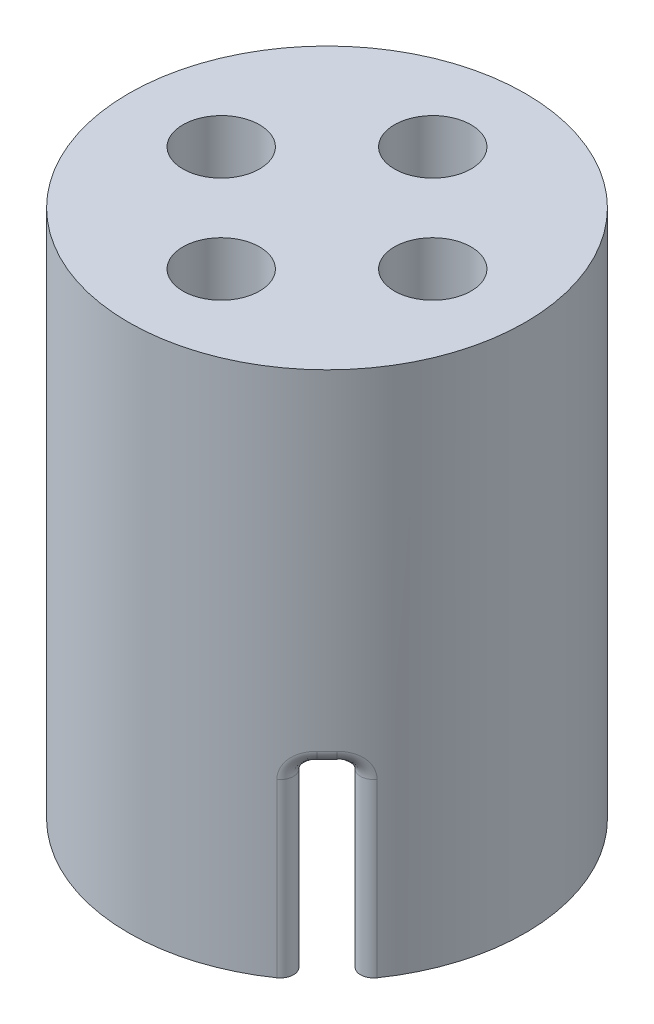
ISO-10303-21;
HEADER;
FILE_DESCRIPTION(('STEP AP214'),'2;1');
FILE_NAME('part.step','',(''),(''),'','','');
FILE_SCHEMA(('AUTOMOTIVE_DESIGN { 1 0 10303 214 1 1 1 1 }'));
ENDSEC;
DATA;
#1=APPLICATION_CONTEXT('core data for automotive mechanical design processes');
#2=APPLICATION_PROTOCOL_DEFINITION('international standard','automotive_design',2000,#1);
#3=PRODUCT_CONTEXT('',#1,'mechanical');
#4=PRODUCT('Part','Part','',(#3));
#5=PRODUCT_RELATED_PRODUCT_CATEGORY('part','',(#4));
#6=PRODUCT_DEFINITION_FORMATION('','',#4);
#7=PRODUCT_DEFINITION_CONTEXT('part definition',#1,'design');
#8=PRODUCT_DEFINITION('design','',#6,#7);
#9=PRODUCT_DEFINITION_SHAPE('','',#8);
#10=(LENGTH_UNIT() NAMED_UNIT(*) SI_UNIT(.MILLI.,.METRE.));
#11=(NAMED_UNIT(*) PLANE_ANGLE_UNIT() SI_UNIT($,.RADIAN.));
#12=(NAMED_UNIT(*) SI_UNIT($,.STERADIAN.) SOLID_ANGLE_UNIT());
#13=UNCERTAINTY_MEASURE_WITH_UNIT(LENGTH_MEASURE(1.E-05),#10,'distance_accuracy_value','');
#14=(GEOMETRIC_REPRESENTATION_CONTEXT(3) GLOBAL_UNCERTAINTY_ASSIGNED_CONTEXT((#13)) GLOBAL_UNIT_ASSIGNED_CONTEXT((#10,
#11,#12)) REPRESENTATION_CONTEXT('',''));
#15=CARTESIAN_POINT('',(0.,0.,0.));
#16=DIRECTION('',(0.,0.,1.));
#17=DIRECTION('',(1.,0.,0.));
#18=AXIS2_PLACEMENT_3D('',#15,#16,#17);
#19=CARTESIAN_POINT('',(-26.6773001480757,-26.,-35.2864937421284));
#20=DIRECTION('',(0.,1.,0.));
#21=DIRECTION('',(0.,0.,1.));
#22=AXIS2_PLACEMENT_3D('',#19,#20,#21);
#23=CYLINDRICAL_SURFACE('',#22,7.5);
#24=CARTESIAN_POINT('',(-31.6876670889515,-19.0276056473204,-40.1750121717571));
#25=CARTESIAN_POINT('',(-32.0389740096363,-19.0293296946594,-40.5333489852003));
#26=CARTESIAN_POINT('',(-31.9214228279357,-18.5552112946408,-40.6483196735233));
#27=CARTESIAN_POINT('',(-31.7066918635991,-19.0184593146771,-40.1568487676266));
#28=CARTESIAN_POINT('',(-32.0591348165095,-19.0187103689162,-40.5119218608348));
#29=CARTESIAN_POINT('',(-31.9617287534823,-18.5369186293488,-40.6089366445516));
#30=CARTESIAN_POINT('',(-31.7258218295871,-19.011556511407,-40.1376959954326));
#31=CARTESIAN_POINT('',(-32.080241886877,-19.0108832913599,-40.4894417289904));
#32=CARTESIAN_POINT('',(-32.0027337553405,-18.5231130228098,-40.5679072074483));
#33=CARTESIAN_POINT('',(-31.7636841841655,-19.0023299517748,-40.0979525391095));
#34=CARTESIAN_POINT('',(-32.1231292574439,-19.001046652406,-40.4436443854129));
#35=CARTESIAN_POINT('',(-32.0848751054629,-18.5046599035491,-40.4837503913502));
#36=CARTESIAN_POINT('',(-31.782416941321,-19.0000017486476,-40.0773632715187));
#37=CARTESIAN_POINT('',(-32.1449627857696,-18.9990153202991,-40.4202705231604));
#38=CARTESIAN_POINT('',(-32.1260112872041,-18.5000034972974,-40.4406250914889));
#39=CARTESIAN_POINT('',(-31.8190909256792,-18.9999982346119,-40.0350487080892));
#40=CARTESIAN_POINT('',(-32.188530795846,-19.0009960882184,-40.3734753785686));
#41=CARTESIAN_POINT('',(-32.2076201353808,-18.4999964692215,-40.3529727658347));
#42=CARTESIAN_POINT('',(-31.8370228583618,-19.0023676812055,-40.0133144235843));
#43=CARTESIAN_POINT('',(-32.2103211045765,-19.0050812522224,-40.349992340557));
#44=CARTESIAN_POINT('',(-32.2480826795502,-18.5047353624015,-40.3084362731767));
#45=CARTESIAN_POINT('',(-31.8714304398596,-19.0117568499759,-39.9695667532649));
#46=CARTESIAN_POINT('',(-32.2526029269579,-19.0190225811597,-40.3043494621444));
#47=CARTESIAN_POINT('',(-32.3268168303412,-18.5235136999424,-40.2196948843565));
#48=CARTESIAN_POINT('',(-31.8879062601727,-19.0187760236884,-39.9475534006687));
#49=CARTESIAN_POINT('',(-32.2731428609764,-19.0289230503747,-40.2821369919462));
#50=CARTESIAN_POINT('',(-32.3650886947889,-18.5375520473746,-40.1754899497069));
#51=CARTESIAN_POINT('',(-31.9190406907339,-19.037238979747,-39.903999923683));
#52=CARTESIAN_POINT('',(-32.3121008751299,-19.053714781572,-40.2400762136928));
#53=CARTESIAN_POINT('',(-32.4384583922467,-18.5744779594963,-40.0888141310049));
#54=CARTESIAN_POINT('',(-31.9337012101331,-19.0486780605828,-39.8824593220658));
#55=CARTESIAN_POINT('',(-32.3305481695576,-19.068662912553,-40.2201968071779));
#56=CARTESIAN_POINT('',(-32.4735595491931,-18.597356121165,-40.0463414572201));
#57=CARTESIAN_POINT('',(-31.9610220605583,-19.075668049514,-39.8405651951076));
#58=CARTESIAN_POINT('',(-32.3647952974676,-19.1024715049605,-40.1835431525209));
#59=CARTESIAN_POINT('',(-32.5399113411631,-18.6513360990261,-39.9643754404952));
#60=CARTESIAN_POINT('',(-31.9736795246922,-19.091224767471,-39.820213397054));
#61=CARTESIAN_POINT('',(-32.3805922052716,-19.1213974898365,-40.166774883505));
#62=CARTESIAN_POINT('',(-32.5711564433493,-18.6824495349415,-39.9248864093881));
#63=CARTESIAN_POINT('',(-31.9969318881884,-19.1261378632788,-39.7813616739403));
#64=CARTESIAN_POINT('',(-32.4092940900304,-19.1620001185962,-40.1367278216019));
#65=CARTESIAN_POINT('',(-32.6293397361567,-18.7522757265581,-39.8499895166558));
#66=CARTESIAN_POINT('',(-32.0075111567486,-19.145520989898,-39.7628762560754));
#67=CARTESIAN_POINT('',(-32.4221536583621,-19.1837336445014,-40.1235047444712));
#68=CARTESIAN_POINT('',(-32.6562450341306,-18.791041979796,-39.814613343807));
#69=CARTESIAN_POINT('',(-32.0264441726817,-19.1874812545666,-39.7286859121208));
#70=CARTESIAN_POINT('',(-32.4447726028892,-19.2285131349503,-40.1007605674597));
#71=CARTESIAN_POINT('',(-32.7049893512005,-18.8749625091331,-39.7495218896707));
#72=CARTESIAN_POINT('',(-32.0347979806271,-19.2100583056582,-39.7129809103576));
#73=CARTESIAN_POINT('',(-32.4544942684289,-19.2515628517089,-40.0912835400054));
#74=CARTESIAN_POINT('',(-32.7268285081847,-18.9201166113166,-39.7198064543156));
#75=CARTESIAN_POINT('',(-32.0493016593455,-19.257853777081,-39.6849999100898));
#76=CARTESIAN_POINT('',(-32.4710288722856,-19.2979486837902,-40.0756436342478));
#77=CARTESIAN_POINT('',(-32.7651278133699,-19.0157075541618,-39.6670671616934));
#78=CARTESIAN_POINT('',(-32.0554454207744,-19.2830792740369,-39.6727334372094));
#79=CARTESIAN_POINT('',(-32.4777919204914,-19.3212504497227,-40.0695349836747));
#80=CARTESIAN_POINT('',(-32.7815730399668,-19.0661585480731,-39.6440618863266));
#81=CARTESIAN_POINT('',(-32.0655125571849,-19.3353718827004,-39.652278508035));
#82=CARTESIAN_POINT('',(-32.4886705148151,-19.3674044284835,-40.0600248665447));
#83=CARTESIAN_POINT('',(-32.8087103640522,-19.1707437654,-39.6057947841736));
#84=CARTESIAN_POINT('',(-32.0694391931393,-19.3624362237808,-39.6440840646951));
#85=CARTESIAN_POINT('',(-32.4927555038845,-19.3901940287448,-40.056652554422));
#86=CARTESIAN_POINT('',(-32.8194109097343,-19.2248724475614,-39.5905215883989));
#87=CARTESIAN_POINT('',(-32.0750778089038,-19.4173320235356,-39.6322220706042));
#88=CARTESIAN_POINT('',(-32.4985695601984,-19.4350321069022,-40.051956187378));
#89=CARTESIAN_POINT('',(-32.8348276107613,-19.3346640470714,-39.5684369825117));
#90=CARTESIAN_POINT('',(-32.0768151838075,-19.4451507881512,-39.6285026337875));
#91=CARTESIAN_POINT('',(-32.5003054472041,-19.4570106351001,-40.050625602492));
#92=CARTESIAN_POINT('',(-32.8396123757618,-19.3903015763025,-39.5615285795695));
#93=CARTESIAN_POINT('',(-32.078172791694,-19.5010584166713,-39.6255996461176));
#94=CARTESIAN_POINT('',(-32.5016699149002,-19.5008809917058,-40.0495746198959));
#95=CARTESIAN_POINT('',(-32.8433494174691,-19.5021168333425,-39.5561357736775));
#96=CARTESIAN_POINT('',(-32.0777925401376,-19.5291473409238,-39.6264171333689));
#97=CARTESIAN_POINT('',(-32.5012930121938,-19.5226917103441,-40.0498584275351));
#98=CARTESIAN_POINT('',(-32.8423003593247,-19.5582946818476,-39.5576532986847));
#99=CARTESIAN_POINT('',(-32.0749276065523,-19.5844498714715,-39.6325241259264));
#100=CARTESIAN_POINT('',(-32.4983985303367,-19.5665047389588,-40.0521111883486));
#101=CARTESIAN_POINT('',(-32.8344243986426,-19.668899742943,-39.5690028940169));
#102=CARTESIAN_POINT('',(-32.0724669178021,-19.6116698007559,-39.6377626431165));
#103=CARTESIAN_POINT('',(-32.4959156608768,-19.5884230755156,-40.0540528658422));
#104=CARTESIAN_POINT('',(-32.8276633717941,-19.7233396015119,-39.5787401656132));
#105=CARTESIAN_POINT('',(-32.0654516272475,-19.6648283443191,-39.6523566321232));
#106=CARTESIAN_POINT('',(-32.4885644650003,-19.632812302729,-40.060155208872));
#107=CARTESIAN_POINT('',(-32.8085705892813,-19.8296566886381,-39.6059529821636));
#108=CARTESIAN_POINT('',(-32.0608957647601,-19.6907661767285,-39.6617145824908));
#109=CARTESIAN_POINT('',(-32.483718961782,-19.6552152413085,-40.0642957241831));
#110=CARTESIAN_POINT('',(-32.7962354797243,-19.881532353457,-39.6234331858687));
#111=CARTESIAN_POINT('',(-32.0552832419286,-19.7156783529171,-39.6729848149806));
#112=CARTESIAN_POINT('',(-32.4775473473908,-19.6780654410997,-40.0698160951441));
#113=CARTESIAN_POINT('',(-32.7811777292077,-19.9313567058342,-39.6445527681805));
#114=(BOUNDED_SURFACE() B_SPLINE_SURFACE(3,2,((#24,#25,#26),(#27,#28,#29),(#30,#31,#32),(#33,
#34,#35),(#36,#37,#38),(#39,#40,#41),(#42,#43,#44),(#45,#46,#47),(#48,#49,#50),(#51,#52,#53),
(#54,#55,#56),(#57,#58,#59),(#60,#61,#62),(#63,#64,#65),(#66,#67,#68),(#69,#70,#71),(#72,#73,
#74),(#75,#76,#77),(#78,#79,#80),(#81,#82,#83),(#84,#85,#86),(#87,#88,#89),(#90,#91,#92),(#93,
#94,#95),(#96,#97,#98),(#99,#100,#101),(#102,#103,#104),(#105,#106,#107),(#108,#109,#110),(#111,
#112,#113)),.UNSPECIFIED.,.F.,.F.,.F.) B_SPLINE_SURFACE_WITH_KNOTS((4,2,2,2,2,2,2,2,2,2,2,2,2,2,
4),(3,3),(0.,0.166834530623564,0.333506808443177,0.501774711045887,0.670022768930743,
0.83809234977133,1.00640034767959,1.17592947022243,1.34545397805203,1.51544357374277,
1.68518249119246,1.85293377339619,2.02072344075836,2.18660400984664,2.35258452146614),(0.,1.),
.UNSPECIFIED.) GEOMETRIC_REPRESENTATION_ITEM() RATIONAL_B_SPLINE_SURFACE(((1.,0.705819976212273,
1.),(1.,0.706915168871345,1.),(1.,0.707587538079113,1.),(1.,0.708033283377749,1.),(1.,
0.70780753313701,1.),(1.,0.706399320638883,1.),(1.,0.705207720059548,1.),(1.,0.701925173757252,
1.),(1.,0.699834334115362,1.),(1.,0.694911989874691,1.),(1.,0.692081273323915,1.),(1.,
0.685912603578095,1.),(1.,0.682573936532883,1.),(1.,0.67567091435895,1.),(1.,0.672105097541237,
1.),(1.,0.665122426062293,1.),(1.,0.661705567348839,1.),(1.,0.655374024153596,1.),(1.,
0.652460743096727,1.),(1.,0.647483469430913,1.),(1.,0.645418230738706,1.),(1.,0.642397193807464,
1.),(1.,0.641428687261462,1.),(1.,0.640673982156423,1.),(1.,0.640888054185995,1.),(1.,
0.642469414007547,1.),(1.,0.643823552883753,1.),(1.,0.647487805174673,1.),(1.,0.649798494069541,
1.),(1.,0.65249648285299,1.))) REPRESENTATION_ITEM('') SURFACE());
#115=CARTESIAN_POINT('',(-32.7811777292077,-19.9313567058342,-39.6445527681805));
#116=CARTESIAN_POINT('',(-32.7962354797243,-19.881532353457,-39.6234331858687));
#117=CARTESIAN_POINT('',(-32.8085705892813,-19.8296566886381,-39.6059529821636));
#118=CARTESIAN_POINT('',(-32.8276633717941,-19.7233396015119,-39.5787401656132));
#119=CARTESIAN_POINT('',(-32.8344243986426,-19.668899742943,-39.5690028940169));
#120=CARTESIAN_POINT('',(-32.8423003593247,-19.5582946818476,-39.5576532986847));
#121=CARTESIAN_POINT('',(-32.8433494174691,-19.5021168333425,-39.5561357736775));
#122=CARTESIAN_POINT('',(-32.8396123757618,-19.3903015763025,-39.5615285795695));
#123=CARTESIAN_POINT('',(-32.8348276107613,-19.3346640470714,-39.5684369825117));
#124=CARTESIAN_POINT('',(-32.8194109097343,-19.2248724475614,-39.5905215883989));
#125=CARTESIAN_POINT('',(-32.8087103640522,-19.1707437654,-39.6057947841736));
#126=CARTESIAN_POINT('',(-32.7815730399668,-19.0661585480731,-39.6440618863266));
#127=CARTESIAN_POINT('',(-32.7651278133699,-19.0157075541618,-39.6670671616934));
#128=CARTESIAN_POINT('',(-32.7268285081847,-18.9201166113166,-39.7198064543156));
#129=CARTESIAN_POINT('',(-32.7049893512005,-18.8749625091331,-39.7495218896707));
#130=CARTESIAN_POINT('',(-32.6562450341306,-18.791041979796,-39.814613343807));
#131=CARTESIAN_POINT('',(-32.6293397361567,-18.7522757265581,-39.8499895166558));
#132=CARTESIAN_POINT('',(-32.5711564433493,-18.6824495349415,-39.9248864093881));
#133=CARTESIAN_POINT('',(-32.5399113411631,-18.6513360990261,-39.9643754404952));
#134=CARTESIAN_POINT('',(-32.4735595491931,-18.597356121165,-40.0463414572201));
#135=CARTESIAN_POINT('',(-32.4384583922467,-18.5744779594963,-40.0888141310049));
#136=CARTESIAN_POINT('',(-32.3650886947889,-18.5375520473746,-40.1754899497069));
#137=CARTESIAN_POINT('',(-32.3268168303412,-18.5235136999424,-40.2196948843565));
#138=CARTESIAN_POINT('',(-32.2480826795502,-18.5047353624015,-40.3084362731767));
#139=CARTESIAN_POINT('',(-32.2076201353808,-18.4999964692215,-40.3529727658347));
#140=CARTESIAN_POINT('',(-32.1260112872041,-18.5000034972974,-40.4406250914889));
#141=CARTESIAN_POINT('',(-32.0848751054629,-18.5046599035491,-40.4837503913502));
#142=CARTESIAN_POINT('',(-32.0027337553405,-18.5231130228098,-40.5679072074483));
#143=CARTESIAN_POINT('',(-31.9617287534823,-18.5369186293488,-40.6089366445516));
#144=CARTESIAN_POINT('',(-31.9214228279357,-18.5552112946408,-40.6483196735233));
#145=B_SPLINE_CURVE_WITH_KNOTS('',3,(#115,#116,#117,#118,#119,#120,#121,#122,#123,#124,#125,
#126,#127,#128,#129,#130,#131,#132,#133,#134,#135,#136,#137,#138,#139,#140,#141,#142,#143,#144),
.UNSPECIFIED.,.F.,.F.,(4,2,2,2,2,2,2,2,2,2,2,2,2,2,4),(0.,0.165980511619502,0.331861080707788,
0.499650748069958,0.667402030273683,0.83714094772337,1.00713054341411,1.17665505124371,
1.34618417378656,1.51449217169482,1.6825617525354,1.85080981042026,2.01907771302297,
2.18574999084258,2.35258452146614),.UNSPECIFIED.);
#146=CARTESIAN_POINT('',(-32.842378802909,-19.5,-39.5575363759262));
#147=VERTEX_POINT('',#146);
#148=CARTESIAN_POINT('',(-32.1666213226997,-18.5,-40.3970077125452));
#149=VERTEX_POINT('',#148);
#150=EDGE_CURVE('E432',#147,#149,#145,.T.);
#151=ORIENTED_EDGE('',*,*,#150,.F.);
#152=DIRECTION('',(0.,1.,0.));
#153=VECTOR('',#152,1.);
#154=CARTESIAN_POINT('',(-32.842378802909,-26.,-39.5575363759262));
#155=LINE('',#154,#153);
#156=CARTESIAN_POINT('',(-32.842378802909,-26.,-39.5575363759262));
#157=VERTEX_POINT('',#156);
#158=EDGE_CURVE('E157',#147,#157,#155,.F.);
#159=ORIENTED_EDGE('',*,*,#158,.T.);
#160=CARTESIAN_POINT('',(-26.6773001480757,-26.,-35.2864937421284));
#161=DIRECTION('',(0.,-1.,0.));
#162=DIRECTION('',(0.,0.,-1.));
#163=AXIS2_PLACEMENT_3D('',#160,#161,#162);
#164=CIRCLE('',#163,7.5);
#165=CARTESIAN_POINT('',(-22.4062575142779,-26.,-29.1214150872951));
#166=VERTEX_POINT('',#165);
#167=EDGE_CURVE('E150',#166,#157,#164,.T.);
#168=ORIENTED_EDGE('',*,*,#167,.F.);
#169=DIRECTION('',(0.,1.,0.));
#170=VECTOR('',#169,1.);
#171=CARTESIAN_POINT('',(-22.4062575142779,-26.,-29.1214150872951));
#172=LINE('',#171,#170);
#173=CARTESIAN_POINT('',(-22.4062575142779,-19.5,-29.1214150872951));
#174=VERTEX_POINT('',#173);
#175=EDGE_CURVE('E430',#166,#174,#172,.T.);
#176=ORIENTED_EDGE('',*,*,#175,.T.);
#177=CARTESIAN_POINT('',(-22.3112914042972,-19.6629434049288,-29.8984266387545));
#178=CARTESIAN_POINT('',(-21.9035069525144,-19.6315711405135,-29.4753486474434));
#179=CARTESIAN_POINT('',(-22.3575612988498,-19.8258868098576,-29.1554370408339));
#180=CARTESIAN_POINT('',(-22.3199067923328,-19.6368134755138,-29.8942666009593));
#181=CARTESIAN_POINT('',(-21.9071972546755,-19.6090479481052,-29.4709574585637));
#182=CARTESIAN_POINT('',(-22.3736360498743,-19.7736269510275,-29.1441358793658));
#183=CARTESIAN_POINT('',(-22.3264446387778,-19.6099045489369,-29.8911523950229));
#184=CARTESIAN_POINT('',(-21.9098081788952,-19.5870193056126,-29.4677405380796));
#185=CARTESIAN_POINT('',(-22.3858116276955,-19.7198090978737,-29.1356284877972));
#186=CARTESIAN_POINT('',(-22.3352082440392,-19.555330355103,-29.8870067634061));
#187=CARTESIAN_POINT('',(-21.9131901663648,-19.5432881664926,-29.4634933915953));
#188=CARTESIAN_POINT('',(-22.402116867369,-19.610660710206,-29.1242710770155));
#189=CARTESIAN_POINT('',(-22.3374377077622,-19.5276657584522,-29.8859735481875));
#190=CARTESIAN_POINT('',(-21.9139507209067,-19.5216596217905,-29.4624760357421));
#191=CARTESIAN_POINT('',(-22.4062534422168,-19.5553315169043,-29.1214161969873));
#192=CARTESIAN_POINT('',(-22.3374429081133,-19.4721491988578,-29.8859738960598));
#193=CARTESIAN_POINT('',(-21.9139402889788,-19.4781953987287,-29.4624818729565));
#194=CARTESIAN_POINT('',(-22.4062616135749,-19.4442983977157,-29.1214139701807));
#195=CARTESIAN_POINT('',(-22.3351887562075,-19.444297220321,-29.8870213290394));
#196=CARTESIAN_POINT('',(-21.9131590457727,-19.4564395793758,-29.4635187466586));
#197=CARTESIAN_POINT('',(-22.4020777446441,-19.3885944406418,-29.1243049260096));
#198=CARTESIAN_POINT('',(-22.3262915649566,-19.3893995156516,-29.8912192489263));
#199=CARTESIAN_POINT('',(-21.9097737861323,-19.4123979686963,-29.4677979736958));
#200=CARTESIAN_POINT('',(-22.3855298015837,-19.2787990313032,-29.1358179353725));
#201=CARTESIAN_POINT('',(-22.3196493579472,-19.3623536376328,-29.8943693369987));
#202=CARTESIAN_POINT('',(-21.9071823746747,-19.3901896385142,-29.4710247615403));
#203=CARTESIAN_POINT('',(-22.3731672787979,-19.2247072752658,-29.1444389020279));
#204=CARTESIAN_POINT('',(-22.3023056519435,-19.3098529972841,-29.9027886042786));
#205=CARTESIAN_POINT('',(-21.8995821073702,-19.3451840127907,-29.4799662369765));
#206=CARTESIAN_POINT('',(-22.3407831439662,-19.1197059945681,-29.167261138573));
#207=CARTESIAN_POINT('',(-22.2916085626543,-19.2843965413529,-29.9080554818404));
#208=CARTESIAN_POINT('',(-21.8946023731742,-19.3224540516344,-29.4856493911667));
#209=CARTESIAN_POINT('',(-22.3207698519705,-19.068793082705,-29.1814563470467));
#210=CARTESIAN_POINT('',(-22.2666311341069,-19.2357042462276,-29.9207416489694));
#211=CARTESIAN_POINT('',(-21.8815333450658,-19.2768106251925,-29.4998399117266));
#212=CARTESIAN_POINT('',(-22.2738313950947,-18.9714084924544,-29.2152255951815));
#213=CARTESIAN_POINT('',(-22.252345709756,-19.2124716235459,-29.9281639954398));
#214=CARTESIAN_POINT('',(-21.8734790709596,-19.2539404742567,-29.5083133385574));
#215=CARTESIAN_POINT('',(-22.2468964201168,-18.9249432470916,-29.2348072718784));
#216=CARTESIAN_POINT('',(-22.2206779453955,-19.1686925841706,-29.9452464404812));
#217=CARTESIAN_POINT('',(-21.8536949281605,-19.2088183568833,-29.5283938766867));
#218=CARTESIAN_POINT('',(-22.1868504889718,-18.8373851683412,-29.2792260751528));
#219=CARTESIAN_POINT('',(-22.2032689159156,-19.148172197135,-29.9549260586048));
#220=CARTESIAN_POINT('',(-21.8419767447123,-19.1865822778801,-29.5399898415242));
#221=CARTESIAN_POINT('',(-22.1536861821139,-18.7963443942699,-29.3041088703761));
#222=CARTESIAN_POINT('',(-22.166164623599,-19.1106201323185,-29.9764605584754));
#223=CARTESIAN_POINT('',(-21.8147950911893,-19.1442585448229,-29.5662934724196));
#224=CARTESIAN_POINT('',(-22.0825179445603,-18.7212402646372,-29.3585951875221));
#225=CARTESIAN_POINT('',(-22.1464692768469,-19.0935885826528,-29.9883155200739));
#226=CARTESIAN_POINT('',(-21.7993669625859,-19.1241444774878,-29.5809721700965));
#227=CARTESIAN_POINT('',(-22.0445138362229,-18.6871771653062,-29.3881988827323));
#228=CARTESIAN_POINT('',(-22.1053499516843,-19.0633283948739,-30.0142433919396));
#229=CARTESIAN_POINT('',(-21.7649459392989,-19.0872613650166,-29.6133468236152));
#230=CARTESIAN_POINT('',(-21.9645392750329,-18.6266567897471,-29.451896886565));
#231=CARTESIAN_POINT('',(-22.0839104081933,-19.0501402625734,-30.0283376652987));
#232=CARTESIAN_POINT('',(-21.7459293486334,-19.0704710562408,-29.6310648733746));
#233=CARTESIAN_POINT('',(-21.922532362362,-18.6002805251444,-29.4860338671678));
#234=CARTESIAN_POINT('',(-22.0403129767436,-19.0282022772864,-30.0584448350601));
#235=CARTESIAN_POINT('',(-21.7052291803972,-19.041773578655,-29.668836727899));
#236=CARTESIAN_POINT('',(-21.8363362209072,-18.5564045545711,-29.5577761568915));
#237=CARTESIAN_POINT('',(-22.0181561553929,-19.0194461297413,-30.0744549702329));
#238=CARTESIAN_POINT('',(-21.6835314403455,-19.0297937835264,-29.6889049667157));
#239=CARTESIAN_POINT('',(-21.7921501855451,-18.5388922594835,-29.5953764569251));
#240=CARTESIAN_POINT('',(-21.9739785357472,-19.0066452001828,-30.1080180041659));
#241=CARTESIAN_POINT('',(-21.6386009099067,-19.011643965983,-29.7304935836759));
#242=CARTESIAN_POINT('',(-21.7031702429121,-18.5132904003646,-29.6729836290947));
#243=CARTESIAN_POINT('',(-21.9519576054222,-19.0025774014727,-30.1255629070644));
#244=CARTESIAN_POINT('',(-21.6153309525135,-19.005391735,-29.7520480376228));
#245=CARTESIAN_POINT('',(-21.6583804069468,-18.5051548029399,-29.7129777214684));
#246=CARTESIAN_POINT('',(-21.9086388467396,-18.9992085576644,-30.1618304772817));
#247=CARTESIAN_POINT('',(-21.5683083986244,-18.9990492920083,-29.7957344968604));
#248=CARTESIAN_POINT('',(-21.5693319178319,-18.4984171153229,-29.7944713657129));
#249=CARTESIAN_POINT('',(-21.8873411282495,-18.9999082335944,-30.1805533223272));
#250=CARTESIAN_POINT('',(-21.54449327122,-18.9989330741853,-29.8179242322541));
#251=CARTESIAN_POINT('',(-21.5250733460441,-18.4998164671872,-29.8359711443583));
#252=CARTESIAN_POINT('',(-21.8463202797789,-19.0060396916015,-30.2184054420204));
#253=CARTESIAN_POINT('',(-21.4978119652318,-19.0048367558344,-29.8615618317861));
#254=CARTESIAN_POINT('',(-21.438869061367,-18.5120793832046,-29.9187803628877));
#255=CARTESIAN_POINT('',(-21.826582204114,-19.0114184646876,-30.2375278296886));
#256=CARTESIAN_POINT('',(-21.4748757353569,-19.0107943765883,-29.883073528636));
#257=CARTESIAN_POINT('',(-21.3969030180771,-18.5228369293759,-29.9600867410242));
#258=CARTESIAN_POINT('',(-21.788851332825,-19.0266639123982,-30.2757465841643));
#259=CARTESIAN_POINT('',(-21.4305762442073,-19.0281851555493,-29.9246836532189));
#260=CARTESIAN_POINT('',(-21.3157897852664,-18.5533278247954,-30.0417227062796));
#261=CARTESIAN_POINT('',(-21.7708600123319,-19.0365343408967,-30.2948429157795));
#262=CARTESIAN_POINT('',(-21.4091656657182,-19.0396558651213,-29.9448267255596));
#263=CARTESIAN_POINT('',(-21.2766449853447,-18.5730686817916,-30.0820514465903));
#264=CARTESIAN_POINT('',(-21.7539747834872,-19.0485595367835,-30.3135936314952));
#265=CARTESIAN_POINT('',(-21.3891004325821,-19.0536025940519,-29.96369822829));
#266=CARTESIAN_POINT('',(-21.2394629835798,-18.5971190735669,-30.1212321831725));
#267=(BOUNDED_SURFACE() B_SPLINE_SURFACE(3,2,((#177,#178,#179),(#180,#181,#182),(#183,#184,
#185),(#186,#187,#188),(#189,#190,#191),(#192,#193,#194),(#195,#196,#197),(#198,#199,#200),
(#201,#202,#203),(#204,#205,#206),(#207,#208,#209),(#210,#211,#212),(#213,#214,#215),(#216,#217,
#218),(#219,#220,#221),(#222,#223,#224),(#225,#226,#227),(#228,#229,#230),(#231,#232,#233),
(#234,#235,#236),(#237,#238,#239),(#240,#241,#242),(#243,#244,#245),(#246,#247,#248),(#249,#250,
#251),(#252,#253,#254),(#255,#256,#257),(#258,#259,#260),(#261,#262,#263),(#264,#265,#266)),
.UNSPECIFIED.,.F.,.F.,.F.) B_SPLINE_SURFACE_WITH_KNOTS((4,2,2,2,2,2,2,2,2,2,2,2,2,2,4),(3,3),
(0.,0.165943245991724,0.3317437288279,0.498653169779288,0.665530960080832,0.832227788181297,
0.999162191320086,1.16759749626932,1.33603898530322,1.50619631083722,1.6761112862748,
1.84518848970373,2.01429126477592,2.18150287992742,2.34885449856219),(0.,1.),
.UNSPECIFIED.) GEOMETRIC_REPRESENTATION_ITEM() RATIONAL_B_SPLINE_SURFACE(((1.,0.647514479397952,
1.),(1.,0.645364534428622,1.),(1.,0.643703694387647,1.),(1.,0.641457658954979,1.),(1.,
0.640871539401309,1.),(1.,0.640868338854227,1.),(1.,0.641459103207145,1.),(1.,0.643746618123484,
1.),(1.,0.645443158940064,1.),(1.,0.649741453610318,1.),(1.,0.65234222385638,1.),(1.,
0.658161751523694,1.),(1.,0.661381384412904,1.),(1.,0.668127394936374,1.),(1.,0.671656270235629,
1.),(1.,0.678642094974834,1.),(1.,0.682099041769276,1.),(1.,0.6886508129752,1.),(1.,
0.691741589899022,1.),(1.,0.697240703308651,1.),(1.,0.699650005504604,1.),(1.,0.703587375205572,
1.),(1.,0.705119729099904,1.),(1.,0.707223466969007,1.),(1.,0.707794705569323,1.),(1.,
0.707970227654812,1.),(1.,0.707585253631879,1.),(1.,0.705983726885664,1.),(1.,0.704766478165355,
1.),(1.,0.703190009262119,1.))) REPRESENTATION_ITEM('') SURFACE());
#268=CARTESIAN_POINT('',(-21.2394629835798,-18.5971190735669,-30.1212321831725));
#269=CARTESIAN_POINT('',(-21.2766449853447,-18.5730686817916,-30.0820514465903));
#270=CARTESIAN_POINT('',(-21.3157897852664,-18.5533278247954,-30.0417227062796));
#271=CARTESIAN_POINT('',(-21.3969030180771,-18.5228369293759,-29.9600867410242));
#272=CARTESIAN_POINT('',(-21.438869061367,-18.5120793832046,-29.9187803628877));
#273=CARTESIAN_POINT('',(-21.5250733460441,-18.4998164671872,-29.8359711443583));
#274=CARTESIAN_POINT('',(-21.5693319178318,-18.4984171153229,-29.7944713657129));
#275=CARTESIAN_POINT('',(-21.6583804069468,-18.5051548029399,-29.7129777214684));
#276=CARTESIAN_POINT('',(-21.7031702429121,-18.5132904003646,-29.6729836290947));
#277=CARTESIAN_POINT('',(-21.7921501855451,-18.5388922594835,-29.5953764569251));
#278=CARTESIAN_POINT('',(-21.8363362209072,-18.5564045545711,-29.5577761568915));
#279=CARTESIAN_POINT('',(-21.922532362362,-18.6002805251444,-29.4860338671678));
#280=CARTESIAN_POINT('',(-21.9645392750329,-18.6266567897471,-29.451896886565));
#281=CARTESIAN_POINT('',(-22.0445138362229,-18.6871771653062,-29.3881988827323));
#282=CARTESIAN_POINT('',(-22.0825179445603,-18.7212402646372,-29.3585951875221));
#283=CARTESIAN_POINT('',(-22.1536861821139,-18.7963443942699,-29.3041088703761));
#284=CARTESIAN_POINT('',(-22.1868504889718,-18.8373851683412,-29.2792260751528));
#285=CARTESIAN_POINT('',(-22.2468964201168,-18.9249432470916,-29.2348072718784));
#286=CARTESIAN_POINT('',(-22.2738313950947,-18.9714084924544,-29.2152255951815));
#287=CARTESIAN_POINT('',(-22.3207698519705,-19.068793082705,-29.1814563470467));
#288=CARTESIAN_POINT('',(-22.3407831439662,-19.1197059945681,-29.167261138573));
#289=CARTESIAN_POINT('',(-22.3731672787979,-19.2247072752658,-29.1444389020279));
#290=CARTESIAN_POINT('',(-22.3855298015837,-19.2787990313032,-29.1358179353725));
#291=CARTESIAN_POINT('',(-22.4020777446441,-19.3885944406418,-29.1243049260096));
#292=CARTESIAN_POINT('',(-22.4062616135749,-19.4442983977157,-29.1214139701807));
#293=CARTESIAN_POINT('',(-22.4062534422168,-19.5553315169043,-29.1214161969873));
#294=CARTESIAN_POINT('',(-22.402116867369,-19.610660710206,-29.1242710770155));
#295=CARTESIAN_POINT('',(-22.3858116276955,-19.7198090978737,-29.1356284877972));
#296=CARTESIAN_POINT('',(-22.3736360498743,-19.7736269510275,-29.1441358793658));
#297=CARTESIAN_POINT('',(-22.3575612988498,-19.8258868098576,-29.1554370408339));
#298=B_SPLINE_CURVE_WITH_KNOTS('',3,(#268,#269,#270,#271,#272,#273,#274,#275,#276,#277,#278,
#279,#280,#281,#282,#283,#284,#285,#286,#287,#288,#289,#290,#291,#292,#293,#294,#295,#296,#297),
.UNSPECIFIED.,.F.,.F.,(4,2,2,2,2,2,2,2,2,2,2,2,2,2,4),(0.,0.167351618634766,0.334563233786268,
0.503666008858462,0.672743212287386,0.842658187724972,1.01281551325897,1.18125700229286,
1.3496923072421,1.51662671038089,1.68332353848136,1.8502013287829,2.01711076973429,
2.18291125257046,2.34885449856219),.UNSPECIFIED.);
#299=CARTESIAN_POINT('',(-21.5667861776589,-18.5,-29.7971725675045));
#300=VERTEX_POINT('',#299);
#301=EDGE_CURVE('E423',#300,#174,#298,.T.);
#302=ORIENTED_EDGE('',*,*,#301,.F.);
#303=CARTESIAN_POINT('',(-26.6773001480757,-18.5,-35.2864937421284));
#304=DIRECTION('',(0.,-1.,0.));
#305=DIRECTION('',(0.,0.,-1.));
#306=AXIS2_PLACEMENT_3D('',#303,#304,#305);
#307=CIRCLE('',#306,7.5);
#308=CARTESIAN_POINT('',(-21.1879789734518,-18.5,-30.1759797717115));
#309=VERTEX_POINT('',#308);
#310=EDGE_CURVE('E415',#300,#309,#307,.F.);
#311=ORIENTED_EDGE('',*,*,#310,.T.);
#312=CARTESIAN_POINT('',(-21.6669332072,-19.0276056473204,-30.3979753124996));
#313=CARTESIAN_POINT('',(-21.3156262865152,-19.0293296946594,-30.0396384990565));
#314=CARTESIAN_POINT('',(-21.4331774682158,-18.5552112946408,-29.9246678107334));
#315=CARTESIAN_POINT('',(-21.6479084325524,-19.0184593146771,-30.4161387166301));
#316=CARTESIAN_POINT('',(-21.295465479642,-19.0187103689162,-30.0610656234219));
#317=CARTESIAN_POINT('',(-21.3928715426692,-18.5369186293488,-29.9640508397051));
#318=CARTESIAN_POINT('',(-21.6287784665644,-19.011556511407,-30.4352914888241));
#319=CARTESIAN_POINT('',(-21.2743584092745,-19.0108832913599,-30.0835457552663));
#320=CARTESIAN_POINT('',(-21.351866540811,-18.5231130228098,-30.0050802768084));
#321=CARTESIAN_POINT('',(-21.590916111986,-19.0023299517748,-30.4750349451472));
#322=CARTESIAN_POINT('',(-21.2314710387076,-19.001046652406,-30.1293430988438));
#323=CARTESIAN_POINT('',(-21.2697251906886,-18.5046599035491,-30.0892370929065));
#324=CARTESIAN_POINT('',(-21.5721833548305,-19.0000017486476,-30.495624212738));
#325=CARTESIAN_POINT('',(-21.2096375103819,-18.9990153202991,-30.1527169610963));
#326=CARTESIAN_POINT('',(-21.2285890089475,-18.5000034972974,-30.1323623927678));
#327=CARTESIAN_POINT('',(-21.5355093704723,-18.9999982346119,-30.5379387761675));
#328=CARTESIAN_POINT('',(-21.1660695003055,-19.0009960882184,-30.1995121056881));
#329=CARTESIAN_POINT('',(-21.1469801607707,-18.4999964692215,-30.220014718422));
#330=CARTESIAN_POINT('',(-21.5175774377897,-19.0023676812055,-30.5596730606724));
#331=CARTESIAN_POINT('',(-21.1442791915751,-19.0050812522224,-30.2229951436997));
#332=CARTESIAN_POINT('',(-21.1065176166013,-18.5047353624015,-30.26455121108));
#333=CARTESIAN_POINT('',(-21.4831698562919,-19.0117568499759,-30.6034207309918));
#334=CARTESIAN_POINT('',(-21.1019973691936,-19.0190225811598,-30.2686380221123));
#335=CARTESIAN_POINT('',(-21.0277834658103,-18.5235136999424,-30.3532925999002));
#336=CARTESIAN_POINT('',(-21.4666940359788,-19.0187760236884,-30.625434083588));
#337=CARTESIAN_POINT('',(-21.0814574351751,-19.0289230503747,-30.2908504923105));
#338=CARTESIAN_POINT('',(-20.9895116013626,-18.5375520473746,-30.3974975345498));
#339=CARTESIAN_POINT('',(-21.4355596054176,-19.0372389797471,-30.6689875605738));
#340=CARTESIAN_POINT('',(-21.0424994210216,-19.053714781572,-30.3329112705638));
#341=CARTESIAN_POINT('',(-20.9161419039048,-18.5744779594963,-30.4841733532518));
#342=CARTESIAN_POINT('',(-21.4208990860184,-19.0486780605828,-30.6905281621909));
#343=CARTESIAN_POINT('',(-21.0240521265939,-19.068662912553,-30.3527906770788));
#344=CARTESIAN_POINT('',(-20.8810407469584,-18.597356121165,-30.5266460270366));
#345=CARTESIAN_POINT('',(-21.3935782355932,-19.075668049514,-30.7324222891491));
#346=CARTESIAN_POINT('',(-20.9898049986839,-19.1024715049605,-30.3894443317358));
#347=CARTESIAN_POINT('',(-20.8146889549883,-18.6513360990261,-30.6086120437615));
#348=CARTESIAN_POINT('',(-21.3809207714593,-19.091224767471,-30.7527740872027));
#349=CARTESIAN_POINT('',(-20.97400809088,-19.1213974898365,-30.4062126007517));
#350=CARTESIAN_POINT('',(-20.7834438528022,-18.6824495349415,-30.6481010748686));
#351=CARTESIAN_POINT('',(-21.3576684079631,-19.1261378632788,-30.7916258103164));
#352=CARTESIAN_POINT('',(-20.9453062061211,-19.1620001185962,-30.4362596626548));
#353=CARTESIAN_POINT('',(-20.7252605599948,-18.7522757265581,-30.7229979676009));
#354=CARTESIAN_POINT('',(-21.3470891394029,-19.145520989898,-30.8101112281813));
#355=CARTESIAN_POINT('',(-20.9324466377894,-19.1837336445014,-30.4494827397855));
#356=CARTESIAN_POINT('',(-20.6983552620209,-18.791041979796,-30.7583741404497));
#357=CARTESIAN_POINT('',(-21.3281561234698,-19.1874812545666,-30.8443015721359));
#358=CARTESIAN_POINT('',(-20.9098276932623,-19.2285131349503,-30.472226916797));
#359=CARTESIAN_POINT('',(-20.649610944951,-18.8749625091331,-30.823465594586));
#360=CARTESIAN_POINT('',(-21.3198023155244,-19.2100583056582,-30.8600065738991));
#361=CARTESIAN_POINT('',(-20.9001060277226,-19.2515628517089,-30.4817039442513));
#362=CARTESIAN_POINT('',(-20.6277717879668,-18.9201166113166,-30.8531810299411));
#363=CARTESIAN_POINT('',(-21.305298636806,-19.257853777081,-30.8879875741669));
#364=CARTESIAN_POINT('',(-20.8835714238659,-19.2979486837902,-30.4973438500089));
#365=CARTESIAN_POINT('',(-20.5894724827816,-19.0157075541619,-30.9059203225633));
#366=CARTESIAN_POINT('',(-21.2991548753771,-19.2830792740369,-30.9002540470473));
#367=CARTESIAN_POINT('',(-20.8768083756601,-19.3212504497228,-30.5034525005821));
#368=CARTESIAN_POINT('',(-20.5730272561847,-19.0661585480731,-30.9289255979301));
#369=CARTESIAN_POINT('',(-21.2890877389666,-19.3353718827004,-30.9207089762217));
#370=CARTESIAN_POINT('',(-20.8659297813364,-19.3674044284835,-30.5129626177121));
#371=CARTESIAN_POINT('',(-20.5458899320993,-19.1707437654,-30.9671927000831));
#372=CARTESIAN_POINT('',(-21.2851611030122,-19.3624362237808,-30.9289034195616));
#373=CARTESIAN_POINT('',(-20.861844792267,-19.3901940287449,-30.5163349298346));
#374=CARTESIAN_POINT('',(-20.5351893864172,-19.2248724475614,-30.9824658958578));
#375=CARTESIAN_POINT('',(-21.2795224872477,-19.4173320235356,-30.9407654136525));
#376=CARTESIAN_POINT('',(-20.8560307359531,-19.4350321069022,-30.5210312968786));
#377=CARTESIAN_POINT('',(-20.5197726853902,-19.3346640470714,-31.004550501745));
#378=CARTESIAN_POINT('',(-21.277785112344,-19.4451507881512,-30.9444848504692));
#379=CARTESIAN_POINT('',(-20.8542948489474,-19.4570106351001,-30.5223618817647));
#380=CARTESIAN_POINT('',(-20.5149879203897,-19.3903015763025,-31.0114589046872));
#381=CARTESIAN_POINT('',(-21.2764275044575,-19.5010584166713,-30.9473878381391));
#382=CARTESIAN_POINT('',(-20.8529303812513,-19.5008809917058,-30.5234128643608));
#383=CARTESIAN_POINT('',(-20.5112508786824,-19.5021168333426,-31.0168517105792));
#384=CARTESIAN_POINT('',(-21.2768077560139,-19.5291473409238,-30.9465703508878));
#385=CARTESIAN_POINT('',(-20.8533072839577,-19.5226917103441,-30.5231290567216));
#386=CARTESIAN_POINT('',(-20.5122999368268,-19.5582946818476,-31.015334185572));
#387=CARTESIAN_POINT('',(-21.2796726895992,-19.5844498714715,-30.9404633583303));
#388=CARTESIAN_POINT('',(-20.8562017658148,-19.5665047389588,-30.5208762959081));
#389=CARTESIAN_POINT('',(-20.5201758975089,-19.6688997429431,-31.0039845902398));
#390=CARTESIAN_POINT('',(-21.2821333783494,-19.6116698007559,-30.9352248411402));
#391=CARTESIAN_POINT('',(-20.8586846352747,-19.5884230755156,-30.5189346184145));
#392=CARTESIAN_POINT('',(-20.5269369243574,-19.7233396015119,-30.9942473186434));
#393=CARTESIAN_POINT('',(-21.289148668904,-19.6648283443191,-30.9206308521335));
#394=CARTESIAN_POINT('',(-20.8660358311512,-19.632812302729,-30.5128322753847));
#395=CARTESIAN_POINT('',(-20.5460297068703,-19.8296566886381,-30.9670345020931));
#396=CARTESIAN_POINT('',(-21.2937045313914,-19.6907661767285,-30.9112729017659));
#397=CARTESIAN_POINT('',(-20.8708813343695,-19.6552152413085,-30.5086917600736));
#398=CARTESIAN_POINT('',(-20.5583648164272,-19.881532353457,-30.949554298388));
#399=CARTESIAN_POINT('',(-21.2993170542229,-19.7156783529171,-30.9000026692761));
#400=CARTESIAN_POINT('',(-20.8770529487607,-19.6780654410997,-30.5031713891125));
#401=CARTESIAN_POINT('',(-20.5734225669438,-19.9313567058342,-30.9284347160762));
#402=(BOUNDED_SURFACE() B_SPLINE_SURFACE(3,2,((#312,#313,#314),(#315,#316,#317),(#318,#319,
#320),(#321,#322,#323),(#324,#325,#326),(#327,#328,#329),(#330,#331,#332),(#333,#334,#335),
(#336,#337,#338),(#339,#340,#341),(#342,#343,#344),(#345,#346,#347),(#348,#349,#350),(#351,#352,
#353),(#354,#355,#356),(#357,#358,#359),(#360,#361,#362),(#363,#364,#365),(#366,#367,#368),
(#369,#370,#371),(#372,#373,#374),(#375,#376,#377),(#378,#379,#380),(#381,#382,#383),(#384,#385,
#386),(#387,#388,#389),(#390,#391,#392),(#393,#394,#395),(#396,#397,#398),(#399,#400,#401)),
.UNSPECIFIED.,.F.,.F.,.F.) B_SPLINE_SURFACE_WITH_KNOTS((4,2,2,2,2,2,2,2,2,2,2,2,2,2,4),(3,3),
(0.,0.166834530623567,0.333506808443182,0.501774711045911,0.670022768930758,0.838092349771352,
1.00640034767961,1.17592947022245,1.34545397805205,1.51544357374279,1.68518249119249,
1.85293377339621,2.02072344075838,2.18660400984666,2.35258452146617),(0.,1.),
.UNSPECIFIED.) GEOMETRIC_REPRESENTATION_ITEM() RATIONAL_B_SPLINE_SURFACE(((1.,0.70581997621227,
1.),(1.,0.706915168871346,1.),(1.,0.707587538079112,1.),(1.,0.708033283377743,1.),(1.,
0.707807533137,1.),(1.,0.706399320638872,1.),(1.,0.70520772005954,1.),(1.,0.701925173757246,1.),
(1.,0.699834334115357,1.),(1.,0.694911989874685,1.),(1.,0.692081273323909,1.),(1.,
0.685912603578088,1.),(1.,0.682573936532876,1.),(1.,0.675670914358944,1.),(1.,0.672105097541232,
1.),(1.,0.665122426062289,1.),(1.,0.661705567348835,1.),(1.,0.655374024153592,1.),(1.,
0.652460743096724,1.),(1.,0.647483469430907,1.),(1.,0.645418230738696,1.),(1.,0.642397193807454,
1.),(1.,0.641428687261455,1.),(1.,0.640673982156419,1.),(1.,0.640888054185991,1.),(1.,
0.642469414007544,1.),(1.,0.643823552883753,1.),(1.,0.647487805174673,1.),(1.,0.64979849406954,
1.),(1.,0.652496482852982,1.))) REPRESENTATION_ITEM('') SURFACE());
#403=CARTESIAN_POINT('',(-20.5734225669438,-19.9313567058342,-30.9284347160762));
#404=CARTESIAN_POINT('',(-20.5583648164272,-19.881532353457,-30.949554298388));
#405=CARTESIAN_POINT('',(-20.5460297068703,-19.8296566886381,-30.9670345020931));
#406=CARTESIAN_POINT('',(-20.5269369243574,-19.7233396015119,-30.9942473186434));
#407=CARTESIAN_POINT('',(-20.5201758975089,-19.6688997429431,-31.0039845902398));
#408=CARTESIAN_POINT('',(-20.5122999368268,-19.5582946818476,-31.015334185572));
#409=CARTESIAN_POINT('',(-20.5112508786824,-19.5021168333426,-31.0168517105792));
#410=CARTESIAN_POINT('',(-20.5149879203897,-19.3903015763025,-31.0114589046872));
#411=CARTESIAN_POINT('',(-20.5197726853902,-19.3346640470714,-31.004550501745));
#412=CARTESIAN_POINT('',(-20.5351893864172,-19.2248724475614,-30.9824658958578));
#413=CARTESIAN_POINT('',(-20.5458899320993,-19.1707437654,-30.9671927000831));
#414=CARTESIAN_POINT('',(-20.5730272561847,-19.0661585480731,-30.9289255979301));
#415=CARTESIAN_POINT('',(-20.5894724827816,-19.0157075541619,-30.9059203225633));
#416=CARTESIAN_POINT('',(-20.6277717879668,-18.9201166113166,-30.8531810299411));
#417=CARTESIAN_POINT('',(-20.649610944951,-18.8749625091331,-30.823465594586));
#418=CARTESIAN_POINT('',(-20.6983552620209,-18.791041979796,-30.7583741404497));
#419=CARTESIAN_POINT('',(-20.7252605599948,-18.7522757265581,-30.7229979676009));
#420=CARTESIAN_POINT('',(-20.7834438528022,-18.6824495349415,-30.6481010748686));
#421=CARTESIAN_POINT('',(-20.8146889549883,-18.6513360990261,-30.6086120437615));
#422=CARTESIAN_POINT('',(-20.8810407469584,-18.597356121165,-30.5266460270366));
#423=CARTESIAN_POINT('',(-20.9161419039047,-18.5744779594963,-30.4841733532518));
#424=CARTESIAN_POINT('',(-20.9895116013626,-18.5375520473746,-30.3974975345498));
#425=CARTESIAN_POINT('',(-21.0277834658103,-18.5235136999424,-30.3532925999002));
#426=CARTESIAN_POINT('',(-21.1065176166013,-18.5047353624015,-30.26455121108));
#427=CARTESIAN_POINT('',(-21.1469801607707,-18.4999964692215,-30.220014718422));
#428=CARTESIAN_POINT('',(-21.2285890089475,-18.5000034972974,-30.1323623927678));
#429=CARTESIAN_POINT('',(-21.2697251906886,-18.5046599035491,-30.0892370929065));
#430=CARTESIAN_POINT('',(-21.351866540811,-18.5231130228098,-30.0050802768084));
#431=CARTESIAN_POINT('',(-21.3928715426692,-18.5369186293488,-29.9640508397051));
#432=CARTESIAN_POINT('',(-21.4331774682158,-18.5552112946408,-29.9246678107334));
#433=B_SPLINE_CURVE_WITH_KNOTS('',3,(#403,#404,#405,#406,#407,#408,#409,#410,#411,#412,#413,
#414,#415,#416,#417,#418,#419,#420,#421,#422,#423,#424,#425,#426,#427,#428,#429,#430,#431,#432),
.UNSPECIFIED.,.F.,.F.,(4,2,2,2,2,2,2,2,2,2,2,2,2,2,4),(0.,0.165980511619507,0.331861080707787,
0.499650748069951,0.667402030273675,0.837140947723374,1.00713054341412,1.17665505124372,
1.34618417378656,1.51449217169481,1.68256175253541,1.85080981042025,2.01907771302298,
2.1857499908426,2.35258452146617),.UNSPECIFIED.);
#434=CARTESIAN_POINT('',(-20.5122214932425,-19.5,-31.0154511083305));
#435=VERTEX_POINT('',#434);
#436=EDGE_CURVE('E408',#435,#309,#433,.T.);
#437=ORIENTED_EDGE('',*,*,#436,.F.);
#438=DIRECTION('',(0.,1.,0.));
#439=VECTOR('',#438,1.);
#440=CARTESIAN_POINT('',(-20.5122214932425,-26.,-31.0154511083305));
#441=LINE('',#440,#439);
#442=CARTESIAN_POINT('',(-20.5122214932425,-26.,-31.0154511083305));
#443=VERTEX_POINT('',#442);
#444=EDGE_CURVE('E149',#435,#443,#441,.F.);
#445=ORIENTED_EDGE('',*,*,#444,.T.);
#446=CARTESIAN_POINT('',(-30.9483427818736,-26.,-41.4515723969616));
#447=VERTEX_POINT('',#446);
#448=EDGE_CURVE('E134',#447,#443,#164,.T.);
#449=ORIENTED_EDGE('',*,*,#448,.F.);
#450=DIRECTION('',(0.,1.,0.));
#451=VECTOR('',#450,1.);
#452=CARTESIAN_POINT('',(-30.9483427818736,-26.,-41.4515723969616));
#453=LINE('',#452,#451);
#454=CARTESIAN_POINT('',(-30.9483427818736,-19.5,-41.4515723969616));
#455=VERTEX_POINT('',#454);
#456=EDGE_CURVE('E146',#447,#455,#453,.T.);
#457=ORIENTED_EDGE('',*,*,#456,.T.);
#458=CARTESIAN_POINT('',(-31.0433088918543,-19.6629434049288,-40.6745608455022));
#459=CARTESIAN_POINT('',(-31.4510933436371,-19.6315711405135,-41.0976388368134));
#460=CARTESIAN_POINT('',(-30.9970389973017,-19.8258868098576,-41.4175504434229));
#461=CARTESIAN_POINT('',(-31.0346935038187,-19.6368134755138,-40.6787208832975));
#462=CARTESIAN_POINT('',(-31.447403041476,-19.6090479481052,-41.102030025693));
#463=CARTESIAN_POINT('',(-30.9809642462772,-19.7736269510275,-41.4288516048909));
#464=CARTESIAN_POINT('',(-31.0281556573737,-19.6099045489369,-40.6818350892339));
#465=CARTESIAN_POINT('',(-31.4447921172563,-19.5870193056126,-41.1052469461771));
#466=CARTESIAN_POINT('',(-30.968788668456,-19.7198090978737,-41.4373589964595));
#467=CARTESIAN_POINT('',(-31.0193920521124,-19.555330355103,-40.6859807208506));
#468=CARTESIAN_POINT('',(-31.4414101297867,-19.5432881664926,-41.1094940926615));
#469=CARTESIAN_POINT('',(-30.9524834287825,-19.610660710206,-41.4487164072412));
#470=CARTESIAN_POINT('',(-31.0171625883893,-19.5276657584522,-40.6870139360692));
#471=CARTESIAN_POINT('',(-31.4406495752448,-19.5216596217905,-41.1105114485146));
#472=CARTESIAN_POINT('',(-30.9483468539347,-19.5553315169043,-41.4515712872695));
#473=CARTESIAN_POINT('',(-31.0171573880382,-19.4721491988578,-40.6870135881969));
#474=CARTESIAN_POINT('',(-31.4406600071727,-19.4781953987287,-41.1105056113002));
#475=CARTESIAN_POINT('',(-30.9483386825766,-19.4442983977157,-41.451573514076));
#476=CARTESIAN_POINT('',(-31.019411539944,-19.444297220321,-40.6859661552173));
#477=CARTESIAN_POINT('',(-31.4414412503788,-19.4564395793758,-41.1094687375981));
#478=CARTESIAN_POINT('',(-30.9525225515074,-19.3885944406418,-41.4486825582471));
#479=CARTESIAN_POINT('',(-31.0283087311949,-19.3893995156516,-40.6817682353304));
#480=CARTESIAN_POINT('',(-31.4448265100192,-19.4123979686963,-41.1051895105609));
#481=CARTESIAN_POINT('',(-30.9690704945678,-19.2787990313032,-41.4371695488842));
#482=CARTESIAN_POINT('',(-31.0349509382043,-19.3623536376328,-40.678618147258));
#483=CARTESIAN_POINT('',(-31.4474179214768,-19.3901896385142,-41.1019627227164));
#484=CARTESIAN_POINT('',(-30.9814330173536,-19.2247072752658,-41.4285485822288));
#485=CARTESIAN_POINT('',(-31.052294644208,-19.3098529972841,-40.6701988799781));
#486=CARTESIAN_POINT('',(-31.4550181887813,-19.3451840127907,-41.0930212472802));
#487=CARTESIAN_POINT('',(-31.0138171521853,-19.1197059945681,-41.4057263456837));
#488=CARTESIAN_POINT('',(-31.0629917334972,-19.2843965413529,-40.6649320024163));
#489=CARTESIAN_POINT('',(-31.4599979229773,-19.3224540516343,-41.08733809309));
#490=CARTESIAN_POINT('',(-31.033830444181,-19.068793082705,-41.39153113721));
#491=CARTESIAN_POINT('',(-31.0879691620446,-19.2357042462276,-40.6522458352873));
#492=CARTESIAN_POINT('',(-31.4730669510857,-19.2768106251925,-41.0731475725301));
#493=CARTESIAN_POINT('',(-31.0807689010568,-18.9714084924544,-41.3577618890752));
#494=CARTESIAN_POINT('',(-31.1022545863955,-19.2124716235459,-40.6448234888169));
#495=CARTESIAN_POINT('',(-31.4811212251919,-19.2539404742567,-41.0646741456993));
#496=CARTESIAN_POINT('',(-31.1077038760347,-18.9249432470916,-41.3381802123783));
#497=CARTESIAN_POINT('',(-31.133922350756,-19.1686925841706,-40.6277410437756));
#498=CARTESIAN_POINT('',(-31.500905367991,-19.2088183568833,-41.04459360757));
#499=CARTESIAN_POINT('',(-31.1677498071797,-18.8373851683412,-41.2937614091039));
#500=CARTESIAN_POINT('',(-31.1513313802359,-19.148172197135,-40.6180614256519));
#501=CARTESIAN_POINT('',(-31.5126235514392,-19.1865822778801,-41.0329976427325));
#502=CARTESIAN_POINT('',(-31.2009141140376,-18.7963443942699,-41.2688786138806));
#503=CARTESIAN_POINT('',(-31.1884356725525,-19.1106201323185,-40.5965269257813));
#504=CARTESIAN_POINT('',(-31.5398052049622,-19.1442585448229,-41.0066940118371));
#505=CARTESIAN_POINT('',(-31.2720823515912,-18.7212402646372,-41.2143922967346));
#506=CARTESIAN_POINT('',(-31.2081310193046,-19.0935885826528,-40.5846719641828));
#507=CARTESIAN_POINT('',(-31.5552333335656,-19.1241444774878,-40.9920153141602));
#508=CARTESIAN_POINT('',(-31.3100864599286,-18.6871771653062,-41.1847886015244));
#509=CARTESIAN_POINT('',(-31.2492503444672,-19.0633283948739,-40.5587440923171));
#510=CARTESIAN_POINT('',(-31.5896543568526,-19.0872613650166,-40.9596406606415));
#511=CARTESIAN_POINT('',(-31.3900610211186,-18.6266567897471,-41.1210905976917));
#512=CARTESIAN_POINT('',(-31.2706898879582,-19.0501402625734,-40.544649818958));
#513=CARTESIAN_POINT('',(-31.6086709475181,-19.0704710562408,-40.9419226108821));
#514=CARTESIAN_POINT('',(-31.4320679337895,-18.6002805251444,-41.0869536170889));
#515=CARTESIAN_POINT('',(-31.3142873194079,-19.0282022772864,-40.5145426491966));
#516=CARTESIAN_POINT('',(-31.6493711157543,-19.041773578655,-40.9041507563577));
#517=CARTESIAN_POINT('',(-31.5182640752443,-18.5564045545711,-41.0152113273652));
#518=CARTESIAN_POINT('',(-31.3364441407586,-19.0194461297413,-40.4985325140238));
#519=CARTESIAN_POINT('',(-31.671068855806,-19.0297937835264,-40.884082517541));
#520=CARTESIAN_POINT('',(-31.5624501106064,-18.5388922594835,-40.9776110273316));
#521=CARTESIAN_POINT('',(-31.3806217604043,-19.0066452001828,-40.4649694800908));
#522=CARTESIAN_POINT('',(-31.7159993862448,-19.011643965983,-40.8424939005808));
#523=CARTESIAN_POINT('',(-31.6514300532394,-18.5132904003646,-40.900003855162));
#524=CARTESIAN_POINT('',(-31.4026426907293,-19.0025774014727,-40.4474245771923));
#525=CARTESIAN_POINT('',(-31.739269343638,-19.005391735,-40.8209394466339));
#526=CARTESIAN_POINT('',(-31.6962198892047,-18.5051548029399,-40.8600097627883));
#527=CARTESIAN_POINT('',(-31.4459614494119,-18.9992085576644,-40.411157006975));
#528=CARTESIAN_POINT('',(-31.7862918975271,-18.9990492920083,-40.7772529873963));
#529=CARTESIAN_POINT('',(-31.7852683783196,-18.4984171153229,-40.7785161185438));
#530=CARTESIAN_POINT('',(-31.467259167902,-18.9999082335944,-40.3924341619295));
#531=CARTESIAN_POINT('',(-31.8101070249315,-18.9989330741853,-40.7550632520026));
#532=CARTESIAN_POINT('',(-31.8295269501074,-18.4998164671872,-40.7370163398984));
#533=CARTESIAN_POINT('',(-31.5082800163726,-19.0060396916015,-40.3545820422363));
#534=CARTESIAN_POINT('',(-31.8567883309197,-19.0048367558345,-40.7114256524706));
#535=CARTESIAN_POINT('',(-31.9157312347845,-18.5120793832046,-40.654207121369));
#536=CARTESIAN_POINT('',(-31.5280180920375,-19.0114184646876,-40.3354596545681));
#537=CARTESIAN_POINT('',(-31.8797245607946,-19.0107943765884,-40.6899139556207));
#538=CARTESIAN_POINT('',(-31.9576972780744,-18.5228369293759,-40.6129007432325));
#539=CARTESIAN_POINT('',(-31.5657489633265,-19.0266639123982,-40.2972409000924));
#540=CARTESIAN_POINT('',(-31.9240240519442,-19.0281851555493,-40.6483038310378));
#541=CARTESIAN_POINT('',(-32.0388105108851,-18.5533278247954,-40.5312647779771));
#542=CARTESIAN_POINT('',(-31.5837402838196,-19.0365343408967,-40.2781445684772));
#543=CARTESIAN_POINT('',(-31.9454346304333,-19.0396558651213,-40.6281607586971));
#544=CARTESIAN_POINT('',(-32.0779553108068,-18.5730686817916,-40.4909360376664));
#545=CARTESIAN_POINT('',(-31.6006255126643,-19.0485595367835,-40.2593938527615));
#546=CARTESIAN_POINT('',(-31.9654998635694,-19.0536025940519,-40.6092892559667));
#547=CARTESIAN_POINT('',(-32.1151373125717,-18.5971190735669,-40.4517553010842));
#548=(BOUNDED_SURFACE() B_SPLINE_SURFACE(3,2,((#458,#459,#460),(#461,#462,#463),(#464,#465,
#466),(#467,#468,#469),(#470,#471,#472),(#473,#474,#475),(#476,#477,#478),(#479,#480,#481),
(#482,#483,#484),(#485,#486,#487),(#488,#489,#490),(#491,#492,#493),(#494,#495,#496),(#497,#498,
#499),(#500,#501,#502),(#503,#504,#505),(#506,#507,#508),(#509,#510,#511),(#512,#513,#514),
(#515,#516,#517),(#518,#519,#520),(#521,#522,#523),(#524,#525,#526),(#527,#528,#529),(#530,#531,
#532),(#533,#534,#535),(#536,#537,#538),(#539,#540,#541),(#542,#543,#544),(#545,#546,#547)),
.UNSPECIFIED.,.F.,.F.,.F.) B_SPLINE_SURFACE_WITH_KNOTS((4,2,2,2,2,2,2,2,2,2,2,2,2,2,4),(3,3),
(0.,0.165943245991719,0.331743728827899,0.49865316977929,0.665530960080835,0.832227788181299,
0.999162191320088,1.16759749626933,1.33603898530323,1.50619631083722,1.67611128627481,
1.84518848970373,2.01429126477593,2.18150287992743,2.34885449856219),(0.,1.),
.UNSPECIFIED.) GEOMETRIC_REPRESENTATION_ITEM() RATIONAL_B_SPLINE_SURFACE(((1.,0.64751447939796,
1.),(1.,0.645364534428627,1.),(1.,0.643703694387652,1.),(1.,0.641457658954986,1.),(1.,
0.640871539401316,1.),(1.,0.640868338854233,1.),(1.,0.641459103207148,1.),(1.,0.643746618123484,
1.),(1.,0.645443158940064,1.),(1.,0.649741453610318,1.),(1.,0.652342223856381,1.),(1.,
0.658161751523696,1.),(1.,0.661381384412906,1.),(1.,0.668127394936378,1.),(1.,0.671656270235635,
1.),(1.,0.67864209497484,1.),(1.,0.682099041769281,1.),(1.,0.688650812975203,1.),(1.,
0.691741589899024,1.),(1.,0.69724070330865,1.),(1.,0.699650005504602,1.),(1.,0.703587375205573,
1.),(1.,0.705119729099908,1.),(1.,0.707223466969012,1.),(1.,0.707794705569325,1.),(1.,
0.707970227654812,1.),(1.,0.70758525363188,1.),(1.,0.705983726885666,1.),(1.,0.704766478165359,
1.),(1.,0.703190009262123,1.))) REPRESENTATION_ITEM('') SURFACE());
#549=CARTESIAN_POINT('',(-32.1151373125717,-18.5971190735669,-40.4517553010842));
#550=CARTESIAN_POINT('',(-32.0779553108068,-18.5730686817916,-40.4909360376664));
#551=CARTESIAN_POINT('',(-32.0388105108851,-18.5533278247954,-40.5312647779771));
#552=CARTESIAN_POINT('',(-31.9576972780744,-18.5228369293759,-40.6129007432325));
#553=CARTESIAN_POINT('',(-31.9157312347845,-18.5120793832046,-40.654207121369));
#554=CARTESIAN_POINT('',(-31.8295269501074,-18.4998164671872,-40.7370163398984));
#555=CARTESIAN_POINT('',(-31.7852683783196,-18.4984171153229,-40.7785161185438));
#556=CARTESIAN_POINT('',(-31.6962198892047,-18.5051548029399,-40.8600097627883));
#557=CARTESIAN_POINT('',(-31.6514300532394,-18.5132904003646,-40.900003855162));
#558=CARTESIAN_POINT('',(-31.5624501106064,-18.5388922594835,-40.9776110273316));
#559=CARTESIAN_POINT('',(-31.5182640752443,-18.5564045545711,-41.0152113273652));
#560=CARTESIAN_POINT('',(-31.4320679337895,-18.6002805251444,-41.0869536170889));
#561=CARTESIAN_POINT('',(-31.3900610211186,-18.6266567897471,-41.1210905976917));
#562=CARTESIAN_POINT('',(-31.3100864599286,-18.6871771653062,-41.1847886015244));
#563=CARTESIAN_POINT('',(-31.2720823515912,-18.7212402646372,-41.2143922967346));
#564=CARTESIAN_POINT('',(-31.2009141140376,-18.7963443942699,-41.2688786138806));
#565=CARTESIAN_POINT('',(-31.1677498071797,-18.8373851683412,-41.2937614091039));
#566=CARTESIAN_POINT('',(-31.1077038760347,-18.9249432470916,-41.3381802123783));
#567=CARTESIAN_POINT('',(-31.0807689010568,-18.9714084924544,-41.3577618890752));
#568=CARTESIAN_POINT('',(-31.0338304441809,-19.068793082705,-41.39153113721));
#569=CARTESIAN_POINT('',(-31.0138171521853,-19.1197059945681,-41.4057263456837));
#570=CARTESIAN_POINT('',(-30.9814330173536,-19.2247072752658,-41.4285485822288));
#571=CARTESIAN_POINT('',(-30.9690704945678,-19.2787990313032,-41.4371695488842));
#572=CARTESIAN_POINT('',(-30.9525225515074,-19.3885944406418,-41.4486825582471));
#573=CARTESIAN_POINT('',(-30.9483386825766,-19.4442983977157,-41.451573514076));
#574=CARTESIAN_POINT('',(-30.9483468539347,-19.5553315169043,-41.4515712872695));
#575=CARTESIAN_POINT('',(-30.9524834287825,-19.610660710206,-41.4487164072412));
#576=CARTESIAN_POINT('',(-30.968788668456,-19.7198090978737,-41.4373589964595));
#577=CARTESIAN_POINT('',(-30.9809642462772,-19.7736269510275,-41.4288516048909));
#578=CARTESIAN_POINT('',(-30.9970389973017,-19.8258868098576,-41.4175504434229));
#579=B_SPLINE_CURVE_WITH_KNOTS('',3,(#549,#550,#551,#552,#553,#554,#555,#556,#557,#558,#559,
#560,#561,#562,#563,#564,#565,#566,#567,#568,#569,#570,#571,#572,#573,#574,#575,#576,#577,#578),
.UNSPECIFIED.,.F.,.F.,(4,2,2,2,2,2,2,2,2,2,2,2,2,2,4),(0.,0.167351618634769,0.334563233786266,
0.503666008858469,0.672743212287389,0.842658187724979,1.01281551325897,1.18125700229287,
1.34969230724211,1.5166267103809,1.68332353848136,1.8502013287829,2.0171107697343,
2.18291125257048,2.34885449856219),.UNSPECIFIED.);
#580=CARTESIAN_POINT('',(-31.7878141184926,-18.5,-40.7758149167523));
#581=VERTEX_POINT('',#580);
#582=EDGE_CURVE('E158',#581,#455,#579,.T.);
#583=ORIENTED_EDGE('',*,*,#582,.F.);
#584=CARTESIAN_POINT('',(-26.6773001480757,-18.5,-35.2864937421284));
#585=DIRECTION('',(0.,-1.,0.));
#586=DIRECTION('',(0.,0.,-1.));
#587=AXIS2_PLACEMENT_3D('',#584,#585,#586);
#588=CIRCLE('',#587,7.5);
#589=EDGE_CURVE('E163',#581,#149,#588,.F.);
#590=ORIENTED_EDGE('',*,*,#589,.T.);
#591=EDGE_LOOP('',(#151,#159,#168,#176,#302,#311,#437,#445,#449,#457,#583,#590));
#592=FACE_BOUND('',#591,.T.);
#593=CARTESIAN_POINT('',(-26.6773001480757,-6.,-35.2864937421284));
#594=DIRECTION('',(0.,1.,0.));
#595=DIRECTION('',(0.,0.,1.));
#596=AXIS2_PLACEMENT_3D('',#593,#594,#595);
#597=CIRCLE('',#596,7.5);
#598=CARTESIAN_POINT('',(-26.6773001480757,-6.,-27.7864937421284));
#599=VERTEX_POINT('',#598);
#600=EDGE_CURVE('E196',#599,#599,#597,.T.);
#601=ORIENTED_EDGE('',*,*,#600,.F.);
#602=EDGE_LOOP('',(#601));
#603=FACE_BOUND('',#602,.T.);
#604=ADVANCED_FACE('F41',(#592,#603),#23,.T.);
#605=CARTESIAN_POINT('',(0.,-26.,0.));
#606=DIRECTION('',(0.,-1.,0.));
#607=DIRECTION('',(0.,0.,-1.));
#608=AXIS2_PLACEMENT_3D('',#605,#606,#607);
#609=PLANE('',#608);
#610=CARTESIAN_POINT('',(-22.6773001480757,-26.,-35.2864937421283));
#611=DIRECTION('',(0.,1.,0.));
#612=DIRECTION('',(0.,0.,1.));
#613=AXIS2_PLACEMENT_3D('',#610,#611,#612);
#614=CIRCLE('',#613,1.45);
#615=CARTESIAN_POINT('',(-22.6773001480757,-26.,-33.8364937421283));
#616=VERTEX_POINT('',#615);
#617=EDGE_CURVE('E377',#616,#616,#614,.T.);
#618=ORIENTED_EDGE('',*,*,#617,.T.);
#619=EDGE_LOOP('',(#618));
#620=FACE_BOUND('',#619,.T.);
#621=CARTESIAN_POINT('',(-26.6773001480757,-26.,-39.2864937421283));
#622=DIRECTION('',(0.,1.,0.));
#623=DIRECTION('',(0.,0.,1.));
#624=AXIS2_PLACEMENT_3D('',#621,#622,#623);
#625=CIRCLE('',#624,1.45);
#626=CARTESIAN_POINT('',(-26.6773001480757,-26.,-37.8364937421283));
#627=VERTEX_POINT('',#626);
#628=EDGE_CURVE('E399',#627,#627,#625,.T.);
#629=ORIENTED_EDGE('',*,*,#628,.T.);
#630=EDGE_LOOP('',(#629));
#631=FACE_BOUND('',#630,.T.);
#632=DIRECTION('',(-0.707106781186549,0.,-0.707106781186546));
#633=VECTOR('',#632,1.);
#634=CARTESIAN_POINT('',(4.83492688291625,-26.,-4.83492688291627));
#635=LINE('',#634,#633);
#636=CARTESIAN_POINT('',(-21.2767801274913,-26.,-30.9466338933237));
#637=VERTEX_POINT('',#636);
#638=CARTESIAN_POINT('',(-31.0171599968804,-26.,-40.6870137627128));
#639=VERTEX_POINT('',#638);
#640=EDGE_CURVE('E137',#637,#639,#635,.T.);
#641=ORIENTED_EDGE('',*,*,#640,.T.);
#642=CARTESIAN_POINT('',(-30.6636066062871,-26.,-41.0405671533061));
#643=DIRECTION('',(0.,-1.,0.));
#644=DIRECTION('',(0.,0.,-1.));
#645=AXIS2_PLACEMENT_3D('',#642,#643,#644);
#646=CIRCLE('',#645,0.5);
#647=EDGE_CURVE('E131',#639,#447,#646,.T.);
#648=ORIENTED_EDGE('',*,*,#647,.T.);
#649=ORIENTED_EDGE('',*,*,#448,.T.);
#650=CARTESIAN_POINT('',(-20.923226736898,-26.,-31.300187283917));
#651=DIRECTION('',(0.,-1.,0.));
#652=DIRECTION('',(0.,0.,-1.));
#653=AXIS2_PLACEMENT_3D('',#650,#651,#652);
#654=CIRCLE('',#653,0.5);
#655=EDGE_CURVE('E142',#443,#637,#654,.T.);
#656=ORIENTED_EDGE('',*,*,#655,.T.);
#657=EDGE_LOOP('',(#641,#648,#649,#656));
#658=FACE_BOUND('',#657,.T.);
#659=ADVANCED_FACE('F133',(#620,#631,#658),#609,.T.);
#660=CARTESIAN_POINT('',(-26.6773001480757,-26.,-31.2864937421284));
#661=DIRECTION('',(0.,1.,0.));
#662=DIRECTION('',(0.,0.,1.));
#663=AXIS2_PLACEMENT_3D('',#660,#661,#662);
#664=CIRCLE('',#663,1.45);
#665=CARTESIAN_POINT('',(-26.6773001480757,-26.,-29.8364937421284));
#666=VERTEX_POINT('',#665);
#667=EDGE_CURVE('E385',#666,#666,#664,.T.);
#668=ORIENTED_EDGE('',*,*,#667,.T.);
#669=EDGE_LOOP('',(#668));
#670=FACE_BOUND('',#669,.T.);
#671=CARTESIAN_POINT('',(-30.6773001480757,-26.,-35.2864937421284));
#672=DIRECTION('',(0.,1.,0.));
#673=DIRECTION('',(0.,0.,1.));
#674=AXIS2_PLACEMENT_3D('',#671,#672,#673);
#675=CIRCLE('',#674,1.45);
#676=CARTESIAN_POINT('',(-30.6773001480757,-26.,-33.8364937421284));
#677=VERTEX_POINT('',#676);
#678=EDGE_CURVE('E393',#677,#677,#675,.T.);
#679=ORIENTED_EDGE('',*,*,#678,.T.);
#680=EDGE_LOOP('',(#679));
#681=FACE_BOUND('',#680,.T.);
#682=ORIENTED_EDGE('',*,*,#167,.T.);
#683=CARTESIAN_POINT('',(-32.4313735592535,-26.,-39.2728002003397));
#684=DIRECTION('',(0.,-1.,0.));
#685=DIRECTION('',(0.,0.,-1.));
#686=AXIS2_PLACEMENT_3D('',#683,#684,#685);
#687=CIRCLE('',#686,0.5);
#688=CARTESIAN_POINT('',(-32.0778201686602,-26.,-39.626353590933));
#689=VERTEX_POINT('',#688);
#690=EDGE_CURVE('E174',#157,#689,#687,.T.);
#691=ORIENTED_EDGE('',*,*,#690,.T.);
#692=DIRECTION('',(-0.707106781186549,0.,-0.707106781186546));
#693=VECTOR('',#692,1.);
#694=CARTESIAN_POINT('',(3.77426671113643,-26.,-3.77426671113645));
#695=LINE('',#694,#693);
#696=CARTESIAN_POINT('',(-22.3374402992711,-26.,-29.8859737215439));
#697=VERTEX_POINT('',#696);
#698=EDGE_CURVE('E151',#697,#689,#695,.T.);
#699=ORIENTED_EDGE('',*,*,#698,.F.);
#700=CARTESIAN_POINT('',(-22.6909936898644,-26.,-29.5324203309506));
#701=DIRECTION('',(0.,-1.,0.));
#702=DIRECTION('',(0.,0.,-1.));
#703=AXIS2_PLACEMENT_3D('',#700,#701,#702);
#704=CIRCLE('',#703,0.5);
#705=EDGE_CURVE('E161',#697,#166,#704,.T.);
#706=ORIENTED_EDGE('',*,*,#705,.T.);
#707=EDGE_LOOP('',(#682,#691,#699,#706));
#708=FACE_BOUND('',#707,.T.);
#709=ADVANCED_FACE('F333',(#670,#681,#708),#609,.T.);
#710=CARTESIAN_POINT('',(4.83492688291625,-19.,-4.83492688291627));
#711=DIRECTION('',(-0.707106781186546,0.,0.707106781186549));
#712=DIRECTION('',(0.707106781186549,0.,0.707106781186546));
#713=AXIS2_PLACEMENT_3D('',#710,#711,#712);
#714=PLANE('',#713);
#715=DIRECTION('',(-0.707106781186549,0.,-0.707106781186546));
#716=VECTOR('',#715,1.);
#717=CARTESIAN_POINT('',(-31.4236877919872,-19.5,-41.0935415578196));
#718=LINE('',#717,#716);
#719=CARTESIAN_POINT('',(-21.2767801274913,-19.5,-30.9466338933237));
#720=VERTEX_POINT('',#719);
#721=CARTESIAN_POINT('',(-31.0171599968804,-19.5,-40.6870137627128));
#722=VERTEX_POINT('',#721);
#723=EDGE_CURVE('E182',#720,#722,#718,.T.);
#724=ORIENTED_EDGE('',*,*,#723,.T.);
#725=DIRECTION('',(0.,-1.,0.));
#726=VECTOR('',#725,1.);
#727=CARTESIAN_POINT('',(-31.0171599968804,-26.,-40.6870137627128));
#728=LINE('',#727,#726);
#729=EDGE_CURVE('E186',#722,#639,#728,.T.);
#730=ORIENTED_EDGE('',*,*,#729,.T.);
#731=ORIENTED_EDGE('',*,*,#640,.F.);
#732=DIRECTION('',(0.,-1.,0.));
#733=VECTOR('',#732,1.);
#734=CARTESIAN_POINT('',(-21.2767801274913,-19.,-30.9466338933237));
#735=LINE('',#734,#733);
#736=EDGE_CURVE('E184',#637,#720,#735,.F.);
#737=ORIENTED_EDGE('',*,*,#736,.T.);
#738=EDGE_LOOP('',(#724,#730,#731,#737));
#739=FACE_BOUND('',#738,.T.);
#740=ADVANCED_FACE('F339',(#739),#714,.T.);
#741=CARTESIAN_POINT('',(3.77426671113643,-19.,-3.77426671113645));
#742=DIRECTION('',(-0.707106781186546,0.,0.707106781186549));
#743=DIRECTION('',(0.707106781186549,0.,0.707106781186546));
#744=AXIS2_PLACEMENT_3D('',#741,#742,#743);
#745=PLANE('',#744);
#746=ORIENTED_EDGE('',*,*,#698,.T.);
#747=DIRECTION('',(0.,1.,0.));
#748=VECTOR('',#747,1.);
#749=CARTESIAN_POINT('',(-32.0778201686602,-19.,-39.626353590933));
#750=LINE('',#749,#748);
#751=CARTESIAN_POINT('',(-32.0778201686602,-19.5,-39.626353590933));
#752=VERTEX_POINT('',#751);
#753=EDGE_CURVE('E180',#689,#752,#750,.T.);
#754=ORIENTED_EDGE('',*,*,#753,.T.);
#755=DIRECTION('',(-0.707106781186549,0.,-0.707106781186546));
#756=VECTOR('',#755,1.);
#757=CARTESIAN_POINT('',(3.77426671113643,-19.5,-3.77426671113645));
#758=LINE('',#757,#756);
#759=CARTESIAN_POINT('',(-22.3374402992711,-19.5,-29.8859737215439));
#760=VERTEX_POINT('',#759);
#761=EDGE_CURVE('E176',#752,#760,#758,.F.);
#762=ORIENTED_EDGE('',*,*,#761,.T.);
#763=DIRECTION('',(0.,1.,0.));
#764=VECTOR('',#763,1.);
#765=CARTESIAN_POINT('',(-22.3374402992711,-19.,-29.8859737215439));
#766=LINE('',#765,#764);
#767=EDGE_CURVE('E178',#760,#697,#766,.F.);
#768=ORIENTED_EDGE('',*,*,#767,.T.);
#769=EDGE_LOOP('',(#746,#754,#762,#768));
#770=FACE_BOUND('',#769,.T.);
#771=ADVANCED_FACE('F345',(#770),#745,.F.);
#772=CARTESIAN_POINT('',(0.,-19.,0.));
#773=DIRECTION('',(0.,-1.,0.));
#774=DIRECTION('',(0.,0.,-1.));
#775=AXIS2_PLACEMENT_3D('',#772,#773,#774);
#776=PLANE('',#775);
#777=DIRECTION('',(-0.707106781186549,0.,-0.707106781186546));
#778=VECTOR('',#777,1.);
#779=CARTESIAN_POINT('',(4.1278201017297,-19.,-4.12782010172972));
#780=LINE('',#779,#778);
#781=CARTESIAN_POINT('',(-21.90748710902,-19.,-30.1631273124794));
#782=VERTEX_POINT('',#781);
#783=CARTESIAN_POINT('',(-31.8006665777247,-19.,-40.056306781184));
#784=VERTEX_POINT('',#783);
#785=EDGE_CURVE('E50',#782,#784,#780,.T.);
#786=ORIENTED_EDGE('',*,*,#785,.T.);
#787=CARTESIAN_POINT('',(-26.6773001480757,-19.,-35.2864937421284));
#788=DIRECTION('',(0.,-1.,0.));
#789=DIRECTION('',(0.,0.,-1.));
#790=AXIS2_PLACEMENT_3D('',#787,#788,#789);
#791=CIRCLE('',#790,7.);
#792=CARTESIAN_POINT('',(-31.4471131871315,-19.,-40.4098601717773));
#793=VERTEX_POINT('',#792);
#794=EDGE_CURVE('E11',#784,#793,#791,.T.);
#795=ORIENTED_EDGE('',*,*,#794,.T.);
#796=DIRECTION('',(-0.707106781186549,0.,-0.707106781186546));
#797=VECTOR('',#796,1.);
#798=CARTESIAN_POINT('',(-21.2238057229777,-19.,-30.1865527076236));
#799=LINE('',#798,#797);
#800=CARTESIAN_POINT('',(-21.5539337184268,-19.,-30.5166807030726));
#801=VERTEX_POINT('',#800);
#802=EDGE_CURVE('E141',#793,#801,#799,.F.);
#803=ORIENTED_EDGE('',*,*,#802,.T.);
#804=CARTESIAN_POINT('',(-26.6773001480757,-19.,-35.2864937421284));
#805=DIRECTION('',(0.,-1.,0.));
#806=DIRECTION('',(0.,0.,-1.));
#807=AXIS2_PLACEMENT_3D('',#804,#805,#806);
#808=CIRCLE('',#807,7.);
#809=EDGE_CURVE('E61',#801,#782,#808,.T.);
#810=ORIENTED_EDGE('',*,*,#809,.T.);
#811=EDGE_LOOP('',(#786,#795,#803,#810));
#812=FACE_BOUND('',#811,.T.);
#813=ADVANCED_FACE('F349',(#812),#776,.T.);
#814=CARTESIAN_POINT('',(-20.923226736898,-26.,-31.300187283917));
#815=DIRECTION('',(0.,1.,0.));
#816=DIRECTION('',(0.,0.,1.));
#817=AXIS2_PLACEMENT_3D('',#814,#815,#816);
#818=CYLINDRICAL_SURFACE('',#817,0.5);
#819=ORIENTED_EDGE('',*,*,#655,.F.);
#820=ORIENTED_EDGE('',*,*,#444,.F.);
#821=CARTESIAN_POINT('',(-20.923226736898,-19.5,-31.300187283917));
#822=DIRECTION('',(0.,1.,0.));
#823=DIRECTION('',(0.,0.,1.));
#824=AXIS2_PLACEMENT_3D('',#821,#822,#823);
#825=CIRCLE('',#824,0.5);
#826=EDGE_CURVE('E45',#720,#435,#825,.T.);
#827=ORIENTED_EDGE('',*,*,#826,.F.);
#828=ORIENTED_EDGE('',*,*,#736,.F.);
#829=EDGE_LOOP('',(#819,#820,#827,#828));
#830=FACE_BOUND('',#829,.T.);
#831=ADVANCED_FACE('F43',(#830),#818,.T.);
#832=ORIENTED_EDGE('',*,*,#826,.T.);
#833=ORIENTED_EDGE('',*,*,#436,.T.);
#834=CARTESIAN_POINT('',(-21.5539337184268,-18.5,-30.5166807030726));
#835=DIRECTION('',(0.681401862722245,0.,-0.731909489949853));
#836=DIRECTION('',(-0.731909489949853,0.,-0.681401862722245));
#837=AXIS2_PLACEMENT_3D('',#834,#835,#836);
#838=CIRCLE('',#837,0.5);
#839=EDGE_CURVE('E318',#801,#309,#838,.F.);
#840=ORIENTED_EDGE('',*,*,#839,.F.);
#841=CARTESIAN_POINT('',(-21.6669332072,-19.0276056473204,-30.3979753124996));
#842=CARTESIAN_POINT('',(-21.6479084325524,-19.0184593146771,-30.4161387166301));
#843=CARTESIAN_POINT('',(-21.6287784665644,-19.011556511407,-30.4352914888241));
#844=CARTESIAN_POINT('',(-21.590916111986,-19.0023299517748,-30.4750349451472));
#845=CARTESIAN_POINT('',(-21.5721833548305,-19.0000017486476,-30.495624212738));
#846=CARTESIAN_POINT('',(-21.5355093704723,-18.9999982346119,-30.5379387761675));
#847=CARTESIAN_POINT('',(-21.5175774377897,-19.0023676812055,-30.5596730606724));
#848=CARTESIAN_POINT('',(-21.4831698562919,-19.0117568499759,-30.6034207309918));
#849=CARTESIAN_POINT('',(-21.4666940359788,-19.0187760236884,-30.625434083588));
#850=CARTESIAN_POINT('',(-21.4355596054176,-19.0372389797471,-30.6689875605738));
#851=CARTESIAN_POINT('',(-21.4208990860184,-19.0486780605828,-30.6905281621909));
#852=CARTESIAN_POINT('',(-21.3935782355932,-19.075668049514,-30.7324222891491));
#853=CARTESIAN_POINT('',(-21.3809207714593,-19.091224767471,-30.7527740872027));
#854=CARTESIAN_POINT('',(-21.3576684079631,-19.1261378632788,-30.7916258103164));
#855=CARTESIAN_POINT('',(-21.3470891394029,-19.145520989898,-30.8101112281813));
#856=CARTESIAN_POINT('',(-21.3281561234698,-19.1874812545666,-30.844301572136));
#857=CARTESIAN_POINT('',(-21.3198023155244,-19.2100583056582,-30.8600065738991));
#858=CARTESIAN_POINT('',(-21.305298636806,-19.257853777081,-30.8879875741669));
#859=CARTESIAN_POINT('',(-21.2991548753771,-19.2830792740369,-30.9002540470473));
#860=CARTESIAN_POINT('',(-21.2890877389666,-19.3353718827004,-30.9207089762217));
#861=CARTESIAN_POINT('',(-21.2851611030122,-19.3624362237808,-30.9289034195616));
#862=CARTESIAN_POINT('',(-21.2795224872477,-19.4173320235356,-30.9407654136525));
#863=CARTESIAN_POINT('',(-21.277785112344,-19.4451507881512,-30.9444848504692));
#864=CARTESIAN_POINT('',(-21.2764275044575,-19.5010584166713,-30.9473878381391));
#865=CARTESIAN_POINT('',(-21.2768077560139,-19.5291473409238,-30.9465703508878));
#866=CARTESIAN_POINT('',(-21.2796726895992,-19.5844498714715,-30.9404633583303));
#867=CARTESIAN_POINT('',(-21.2821333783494,-19.6116698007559,-30.9352248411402));
#868=CARTESIAN_POINT('',(-21.289148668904,-19.6648283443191,-30.9206308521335));
#869=CARTESIAN_POINT('',(-21.2937045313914,-19.6907661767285,-30.9112729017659));
#870=CARTESIAN_POINT('',(-21.2993170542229,-19.7156783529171,-30.9000026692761));
#871=B_SPLINE_CURVE_WITH_KNOTS('',3,(#841,#842,#843,#844,#845,#846,#847,#848,#849,#850,#851,
#852,#853,#854,#855,#856,#857,#858,#859,#860,#861,#862,#863,#864,#865,#866,#867,#868,#869,#870),
.UNSPECIFIED.,.F.,.F.,(4,2,2,2,2,2,2,2,2,2,2,2,2,2,4),(0.,0.166834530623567,0.333506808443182,
0.501774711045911,0.670022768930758,0.838092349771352,1.00640034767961,1.17592947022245,
1.34545397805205,1.51544357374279,1.68518249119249,1.85293377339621,2.02072344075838,
2.18660400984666,2.35258452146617),.UNSPECIFIED.);
#872=EDGE_CURVE('E312',#720,#801,#871,.F.);
#873=ORIENTED_EDGE('',*,*,#872,.F.);
#874=EDGE_LOOP('',(#832,#833,#840,#873));
#875=FACE_BOUND('',#874,.T.);
#876=ADVANCED_FACE('F294',(#875),#402,.T.);
#877=CARTESIAN_POINT('',(-22.6909936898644,-26.,-29.5324203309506));
#878=DIRECTION('',(0.,1.,0.));
#879=DIRECTION('',(0.,0.,1.));
#880=AXIS2_PLACEMENT_3D('',#877,#878,#879);
#881=CYLINDRICAL_SURFACE('',#880,0.5);
#882=ORIENTED_EDGE('',*,*,#705,.F.);
#883=ORIENTED_EDGE('',*,*,#767,.F.);
#884=CARTESIAN_POINT('',(-22.6909936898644,-19.5,-29.5324203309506));
#885=DIRECTION('',(0.,1.,0.));
#886=DIRECTION('',(0.,0.,1.));
#887=AXIS2_PLACEMENT_3D('',#884,#885,#886);
#888=CIRCLE('',#887,0.5);
#889=EDGE_CURVE('E455',#174,#760,#888,.T.);
#890=ORIENTED_EDGE('',*,*,#889,.F.);
#891=ORIENTED_EDGE('',*,*,#175,.F.);
#892=EDGE_LOOP('',(#882,#883,#890,#891));
#893=FACE_BOUND('',#892,.T.);
#894=ADVANCED_FACE('F300',(#893),#881,.T.);
#895=CARTESIAN_POINT('',(-26.6773001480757,-18.5,-35.2864937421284));
#896=DIRECTION('',(0.,-1.,0.));
#897=DIRECTION('',(0.,0.,-1.));
#898=AXIS2_PLACEMENT_3D('',#895,#896,#897);
#899=TOROIDAL_SURFACE('',#898,7.,0.5);
#900=ORIENTED_EDGE('',*,*,#839,.T.);
#901=ORIENTED_EDGE('',*,*,#310,.F.);
#902=CARTESIAN_POINT('',(-21.90748710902,-18.5,-30.1631273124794));
#903=DIRECTION('',(-0.731909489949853,0.,0.681401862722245));
#904=DIRECTION('',(0.681401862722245,0.,0.731909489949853));
#905=AXIS2_PLACEMENT_3D('',#902,#903,#904);
#906=CIRCLE('',#905,0.5);
#907=EDGE_CURVE('E274',#782,#300,#906,.T.);
#908=ORIENTED_EDGE('',*,*,#907,.F.);
#909=ORIENTED_EDGE('',*,*,#809,.F.);
#910=EDGE_LOOP('',(#900,#901,#908,#909));
#911=FACE_BOUND('',#910,.T.);
#912=ADVANCED_FACE('F286',(#911),#899,.T.);
#913=CARTESIAN_POINT('',(4.48137349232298,-19.5,-4.48137349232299));
#914=DIRECTION('',(0.707106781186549,0.,0.707106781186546));
#915=DIRECTION('',(0.707106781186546,0.,-0.707106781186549));
#916=AXIS2_PLACEMENT_3D('',#913,#914,#915);
#917=CYLINDRICAL_SURFACE('',#916,0.5);
#918=ORIENTED_EDGE('',*,*,#872,.T.);
#919=ORIENTED_EDGE('',*,*,#802,.F.);
#920=CARTESIAN_POINT('',(-31.0433088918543,-19.6629434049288,-40.6745608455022));
#921=CARTESIAN_POINT('',(-31.0346935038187,-19.6368134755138,-40.6787208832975));
#922=CARTESIAN_POINT('',(-31.0281556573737,-19.6099045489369,-40.6818350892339));
#923=CARTESIAN_POINT('',(-31.0193920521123,-19.555330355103,-40.6859807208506));
#924=CARTESIAN_POINT('',(-31.0171625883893,-19.5276657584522,-40.6870139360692));
#925=CARTESIAN_POINT('',(-31.0171573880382,-19.4721491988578,-40.6870135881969));
#926=CARTESIAN_POINT('',(-31.019411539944,-19.444297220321,-40.6859661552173));
#927=CARTESIAN_POINT('',(-31.0283087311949,-19.3893995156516,-40.6817682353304));
#928=CARTESIAN_POINT('',(-31.0349509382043,-19.3623536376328,-40.678618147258));
#929=CARTESIAN_POINT('',(-31.052294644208,-19.3098529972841,-40.6701988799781));
#930=CARTESIAN_POINT('',(-31.0629917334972,-19.2843965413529,-40.6649320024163));
#931=CARTESIAN_POINT('',(-31.0879691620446,-19.2357042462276,-40.6522458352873));
#932=CARTESIAN_POINT('',(-31.1022545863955,-19.2124716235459,-40.6448234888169));
#933=CARTESIAN_POINT('',(-31.133922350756,-19.1686925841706,-40.6277410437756));
#934=CARTESIAN_POINT('',(-31.1513313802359,-19.148172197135,-40.6180614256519));
#935=CARTESIAN_POINT('',(-31.1884356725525,-19.1106201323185,-40.5965269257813));
#936=CARTESIAN_POINT('',(-31.2081310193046,-19.0935885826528,-40.5846719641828));
#937=CARTESIAN_POINT('',(-31.2492503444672,-19.0633283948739,-40.5587440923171));
#938=CARTESIAN_POINT('',(-31.2706898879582,-19.0501402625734,-40.544649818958));
#939=CARTESIAN_POINT('',(-31.3142873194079,-19.0282022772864,-40.5145426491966));
#940=CARTESIAN_POINT('',(-31.3364441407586,-19.0194461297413,-40.4985325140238));
#941=CARTESIAN_POINT('',(-31.3806217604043,-19.0066452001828,-40.4649694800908));
#942=CARTESIAN_POINT('',(-31.4026426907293,-19.0025774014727,-40.4474245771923));
#943=CARTESIAN_POINT('',(-31.4459614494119,-18.9992085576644,-40.411157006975));
#944=CARTESIAN_POINT('',(-31.467259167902,-18.9999082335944,-40.3924341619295));
#945=CARTESIAN_POINT('',(-31.5082800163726,-19.0060396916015,-40.3545820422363));
#946=CARTESIAN_POINT('',(-31.5280180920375,-19.0114184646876,-40.3354596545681));
#947=CARTESIAN_POINT('',(-31.5657489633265,-19.0266639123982,-40.2972409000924));
#948=CARTESIAN_POINT('',(-31.5837402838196,-19.0365343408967,-40.2781445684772));
#949=CARTESIAN_POINT('',(-31.6006255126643,-19.0485595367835,-40.2593938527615));
#950=B_SPLINE_CURVE_WITH_KNOTS('',3,(#920,#921,#922,#923,#924,#925,#926,#927,#928,#929,#930,
#931,#932,#933,#934,#935,#936,#937,#938,#939,#940,#941,#942,#943,#944,#945,#946,#947,#948,#949),
.UNSPECIFIED.,.F.,.F.,(4,2,2,2,2,2,2,2,2,2,2,2,2,2,4),(0.,0.165943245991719,0.331743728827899,
0.49865316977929,0.665530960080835,0.832227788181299,0.999162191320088,1.16759749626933,
1.33603898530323,1.50619631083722,1.67611128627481,1.84518848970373,2.01429126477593,
2.18150287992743,2.34885449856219),.UNSPECIFIED.);
#951=EDGE_CURVE('E268',#722,#793,#950,.T.);
#952=ORIENTED_EDGE('',*,*,#951,.F.);
#953=ORIENTED_EDGE('',*,*,#723,.F.);
#954=EDGE_LOOP('',(#918,#919,#952,#953));
#955=FACE_BOUND('',#954,.T.);
#956=ADVANCED_FACE('F283',(#955),#917,.F.);
#957=CARTESIAN_POINT('',(-30.6636066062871,-26.,-41.0405671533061));
#958=DIRECTION('',(0.,1.,0.));
#959=DIRECTION('',(0.,0.,1.));
#960=AXIS2_PLACEMENT_3D('',#957,#958,#959);
#961=CYLINDRICAL_SURFACE('',#960,0.5);
#962=ORIENTED_EDGE('',*,*,#647,.F.);
#963=ORIENTED_EDGE('',*,*,#729,.F.);
#964=CARTESIAN_POINT('',(-30.6636066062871,-19.5,-41.0405671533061));
#965=DIRECTION('',(0.,1.,0.));
#966=DIRECTION('',(0.,0.,1.));
#967=AXIS2_PLACEMENT_3D('',#964,#965,#966);
#968=CIRCLE('',#967,0.5);
#969=EDGE_CURVE('E155',#455,#722,#968,.T.);
#970=ORIENTED_EDGE('',*,*,#969,.F.);
#971=ORIENTED_EDGE('',*,*,#456,.F.);
#972=EDGE_LOOP('',(#962,#963,#970,#971));
#973=FACE_BOUND('',#972,.T.);
#974=ADVANCED_FACE('F153',(#973),#961,.T.);
#975=ORIENTED_EDGE('',*,*,#301,.T.);
#976=ORIENTED_EDGE('',*,*,#889,.T.);
#977=CARTESIAN_POINT('',(-22.3112914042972,-19.6629434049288,-29.8984266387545));
#978=CARTESIAN_POINT('',(-22.3199067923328,-19.6368134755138,-29.8942666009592));
#979=CARTESIAN_POINT('',(-22.3264446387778,-19.6099045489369,-29.8911523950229));
#980=CARTESIAN_POINT('',(-22.3352082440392,-19.555330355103,-29.8870067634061));
#981=CARTESIAN_POINT('',(-22.3374377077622,-19.5276657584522,-29.8859735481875));
#982=CARTESIAN_POINT('',(-22.3374429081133,-19.4721491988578,-29.8859738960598));
#983=CARTESIAN_POINT('',(-22.3351887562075,-19.444297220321,-29.8870213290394));
#984=CARTESIAN_POINT('',(-22.3262915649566,-19.3893995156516,-29.8912192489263));
#985=CARTESIAN_POINT('',(-22.3196493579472,-19.3623536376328,-29.8943693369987));
#986=CARTESIAN_POINT('',(-22.3023056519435,-19.3098529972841,-29.9027886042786));
#987=CARTESIAN_POINT('',(-22.2916085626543,-19.2843965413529,-29.9080554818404));
#988=CARTESIAN_POINT('',(-22.2666311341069,-19.2357042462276,-29.9207416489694));
#989=CARTESIAN_POINT('',(-22.252345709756,-19.2124716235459,-29.9281639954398));
#990=CARTESIAN_POINT('',(-22.2206779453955,-19.1686925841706,-29.9452464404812));
#991=CARTESIAN_POINT('',(-22.2032689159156,-19.148172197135,-29.9549260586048));
#992=CARTESIAN_POINT('',(-22.166164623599,-19.1106201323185,-29.9764605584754));
#993=CARTESIAN_POINT('',(-22.1464692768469,-19.0935885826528,-29.9883155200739));
#994=CARTESIAN_POINT('',(-22.1053499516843,-19.0633283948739,-30.0142433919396));
#995=CARTESIAN_POINT('',(-22.0839104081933,-19.0501402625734,-30.0283376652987));
#996=CARTESIAN_POINT('',(-22.0403129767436,-19.0282022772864,-30.0584448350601));
#997=CARTESIAN_POINT('',(-22.0181561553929,-19.0194461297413,-30.0744549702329));
#998=CARTESIAN_POINT('',(-21.9739785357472,-19.0066452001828,-30.1080180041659));
#999=CARTESIAN_POINT('',(-21.9519576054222,-19.0025774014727,-30.1255629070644));
#1000=CARTESIAN_POINT('',(-21.9086388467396,-18.9992085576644,-30.1618304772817));
#1001=CARTESIAN_POINT('',(-21.8873411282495,-18.9999082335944,-30.1805533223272));
#1002=CARTESIAN_POINT('',(-21.8463202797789,-19.0060396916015,-30.2184054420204));
#1003=CARTESIAN_POINT('',(-21.826582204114,-19.0114184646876,-30.2375278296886));
#1004=CARTESIAN_POINT('',(-21.788851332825,-19.0266639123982,-30.2757465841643));
#1005=CARTESIAN_POINT('',(-21.7708600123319,-19.0365343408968,-30.2948429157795));
#1006=CARTESIAN_POINT('',(-21.7539747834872,-19.0485595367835,-30.3135936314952));
#1007=B_SPLINE_CURVE_WITH_KNOTS('',3,(#977,#978,#979,#980,#981,#982,#983,#984,#985,#986,#987,
#988,#989,#990,#991,#992,#993,#994,#995,#996,#997,#998,#999,#1000,#1001,#1002,#1003,#1004,#1005,
#1006),.UNSPECIFIED.,.F.,.F.,(4,2,2,2,2,2,2,2,2,2,2,2,2,2,4),(0.,0.165943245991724,
0.3317437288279,0.498653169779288,0.665530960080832,0.832227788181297,0.999162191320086,
1.16759749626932,1.33603898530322,1.50619631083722,1.6761112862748,1.84518848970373,
2.01429126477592,2.18150287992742,2.34885449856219),.UNSPECIFIED.);
#1008=EDGE_CURVE('E255',#782,#760,#1007,.F.);
#1009=ORIENTED_EDGE('',*,*,#1008,.F.);
#1010=ORIENTED_EDGE('',*,*,#907,.T.);
#1011=EDGE_LOOP('',(#975,#976,#1009,#1010));
#1012=FACE_BOUND('',#1011,.T.);
#1013=ADVANCED_FACE('F234',(#1012),#267,.T.);
#1014=ORIENTED_EDGE('',*,*,#969,.T.);
#1015=ORIENTED_EDGE('',*,*,#951,.T.);
#1016=CARTESIAN_POINT('',(-31.4471131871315,-18.5,-40.4098601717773));
#1017=DIRECTION('',(0.731909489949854,0.,-0.681401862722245));
#1018=DIRECTION('',(-0.681401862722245,0.,-0.731909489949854));
#1019=AXIS2_PLACEMENT_3D('',#1016,#1017,#1018);
#1020=CIRCLE('',#1019,0.5);
#1021=EDGE_CURVE('E208',#581,#793,#1020,.F.);
#1022=ORIENTED_EDGE('',*,*,#1021,.F.);
#1023=ORIENTED_EDGE('',*,*,#582,.T.);
#1024=EDGE_LOOP('',(#1014,#1015,#1022,#1023));
#1025=FACE_BOUND('',#1024,.T.);
#1026=ADVANCED_FACE('F224',(#1025),#548,.T.);
#1027=CARTESIAN_POINT('',(4.12782010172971,-19.5,-4.12782010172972));
#1028=DIRECTION('',(-0.707106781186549,0.,-0.707106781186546));
#1029=DIRECTION('',(-0.707106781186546,0.,0.707106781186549));
#1030=AXIS2_PLACEMENT_3D('',#1027,#1028,#1029);
#1031=CYLINDRICAL_SURFACE('',#1030,0.5);
#1032=ORIENTED_EDGE('',*,*,#1008,.T.);
#1033=ORIENTED_EDGE('',*,*,#761,.F.);
#1034=CARTESIAN_POINT('',(-31.6876670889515,-19.0276056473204,-40.1750121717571));
#1035=CARTESIAN_POINT('',(-31.7066918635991,-19.0184593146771,-40.1568487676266));
#1036=CARTESIAN_POINT('',(-31.7258218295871,-19.011556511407,-40.1376959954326));
#1037=CARTESIAN_POINT('',(-31.7636841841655,-19.0023299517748,-40.0979525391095));
#1038=CARTESIAN_POINT('',(-31.782416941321,-19.0000017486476,-40.0773632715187));
#1039=CARTESIAN_POINT('',(-31.8190909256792,-18.9999982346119,-40.0350487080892));
#1040=CARTESIAN_POINT('',(-31.8370228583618,-19.0023676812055,-40.0133144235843));
#1041=CARTESIAN_POINT('',(-31.8714304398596,-19.0117568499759,-39.9695667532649));
#1042=CARTESIAN_POINT('',(-31.8879062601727,-19.0187760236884,-39.9475534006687));
#1043=CARTESIAN_POINT('',(-31.9190406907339,-19.037238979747,-39.903999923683));
#1044=CARTESIAN_POINT('',(-31.9337012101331,-19.0486780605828,-39.8824593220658));
#1045=CARTESIAN_POINT('',(-31.9610220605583,-19.075668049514,-39.8405651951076));
#1046=CARTESIAN_POINT('',(-31.9736795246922,-19.091224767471,-39.820213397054));
#1047=CARTESIAN_POINT('',(-31.9969318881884,-19.1261378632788,-39.7813616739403));
#1048=CARTESIAN_POINT('',(-32.0075111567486,-19.145520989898,-39.7628762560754));
#1049=CARTESIAN_POINT('',(-32.0264441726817,-19.1874812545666,-39.7286859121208));
#1050=CARTESIAN_POINT('',(-32.0347979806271,-19.2100583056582,-39.7129809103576));
#1051=CARTESIAN_POINT('',(-32.0493016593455,-19.257853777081,-39.6849999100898));
#1052=CARTESIAN_POINT('',(-32.0554454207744,-19.2830792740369,-39.6727334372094));
#1053=CARTESIAN_POINT('',(-32.0655125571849,-19.3353718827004,-39.652278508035));
#1054=CARTESIAN_POINT('',(-32.0694391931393,-19.3624362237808,-39.6440840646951));
#1055=CARTESIAN_POINT('',(-32.0750778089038,-19.4173320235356,-39.6322220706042));
#1056=CARTESIAN_POINT('',(-32.0768151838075,-19.4451507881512,-39.6285026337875));
#1057=CARTESIAN_POINT('',(-32.078172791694,-19.5010584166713,-39.6255996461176));
#1058=CARTESIAN_POINT('',(-32.0777925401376,-19.5291473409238,-39.6264171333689));
#1059=CARTESIAN_POINT('',(-32.0749276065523,-19.5844498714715,-39.6325241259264));
#1060=CARTESIAN_POINT('',(-32.0724669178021,-19.6116698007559,-39.6377626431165));
#1061=CARTESIAN_POINT('',(-32.0654516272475,-19.6648283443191,-39.6523566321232));
#1062=CARTESIAN_POINT('',(-32.0608957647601,-19.6907661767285,-39.6617145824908));
#1063=CARTESIAN_POINT('',(-32.0552832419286,-19.7156783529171,-39.6729848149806));
#1064=B_SPLINE_CURVE_WITH_KNOTS('',3,(#1034,#1035,#1036,#1037,#1038,#1039,#1040,#1041,#1042,
#1043,#1044,#1045,#1046,#1047,#1048,#1049,#1050,#1051,#1052,#1053,#1054,#1055,#1056,#1057,#1058,
#1059,#1060,#1061,#1062,#1063),.UNSPECIFIED.,.F.,.F.,(4,2,2,2,2,2,2,2,2,2,2,2,2,2,4),(0.,
0.166834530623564,0.333506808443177,0.501774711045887,0.670022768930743,0.83809234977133,
1.00640034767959,1.17592947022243,1.34545397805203,1.51544357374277,1.68518249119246,
1.85293377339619,2.02072344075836,2.18660400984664,2.35258452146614),.UNSPECIFIED.);
#1065=EDGE_CURVE('E199',#784,#752,#1064,.T.);
#1066=ORIENTED_EDGE('',*,*,#1065,.F.);
#1067=ORIENTED_EDGE('',*,*,#785,.F.);
#1068=EDGE_LOOP('',(#1032,#1033,#1066,#1067));
#1069=FACE_BOUND('',#1068,.T.);
#1070=ADVANCED_FACE('F220',(#1069),#1031,.F.);
#1071=CARTESIAN_POINT('',(-26.6773001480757,-18.5,-35.2864937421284));
#1072=DIRECTION('',(0.,-1.,0.));
#1073=DIRECTION('',(0.,0.,-1.));
#1074=AXIS2_PLACEMENT_3D('',#1071,#1072,#1073);
#1075=TOROIDAL_SURFACE('',#1074,7.,0.5);
#1076=ORIENTED_EDGE('',*,*,#1021,.T.);
#1077=ORIENTED_EDGE('',*,*,#794,.F.);
#1078=CARTESIAN_POINT('',(-31.8006665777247,-18.5,-40.056306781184));
#1079=DIRECTION('',(-0.681401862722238,0.,0.73190948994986));
#1080=DIRECTION('',(0.73190948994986,0.,0.681401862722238));
#1081=AXIS2_PLACEMENT_3D('',#1078,#1079,#1080);
#1082=CIRCLE('',#1081,0.5);
#1083=EDGE_CURVE('E195',#149,#784,#1082,.T.);
#1084=ORIENTED_EDGE('',*,*,#1083,.F.);
#1085=ORIENTED_EDGE('',*,*,#589,.F.);
#1086=EDGE_LOOP('',(#1076,#1077,#1084,#1085));
#1087=FACE_BOUND('',#1086,.T.);
#1088=ADVANCED_FACE('F223',(#1087),#1075,.T.);
#1089=ORIENTED_EDGE('',*,*,#1083,.T.);
#1090=ORIENTED_EDGE('',*,*,#1065,.T.);
#1091=CARTESIAN_POINT('',(-32.4313735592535,-19.5,-39.2728002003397));
#1092=DIRECTION('',(0.,1.,0.));
#1093=DIRECTION('',(0.,0.,1.));
#1094=AXIS2_PLACEMENT_3D('',#1091,#1092,#1093);
#1095=CIRCLE('',#1094,0.5);
#1096=EDGE_CURVE('E192',#147,#752,#1095,.F.);
#1097=ORIENTED_EDGE('',*,*,#1096,.F.);
#1098=ORIENTED_EDGE('',*,*,#150,.T.);
#1099=EDGE_LOOP('',(#1089,#1090,#1097,#1098));
#1100=FACE_BOUND('',#1099,.T.);
#1101=ADVANCED_FACE('F226',(#1100),#114,.T.);
#1102=CARTESIAN_POINT('',(-32.4313735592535,-26.,-39.2728002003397));
#1103=DIRECTION('',(0.,1.,0.));
#1104=DIRECTION('',(0.,0.,1.));
#1105=AXIS2_PLACEMENT_3D('',#1102,#1103,#1104);
#1106=CYLINDRICAL_SURFACE('',#1105,0.5);
#1107=ORIENTED_EDGE('',*,*,#1096,.T.);
#1108=ORIENTED_EDGE('',*,*,#753,.F.);
#1109=ORIENTED_EDGE('',*,*,#690,.F.);
#1110=ORIENTED_EDGE('',*,*,#158,.F.);
#1111=EDGE_LOOP('',(#1107,#1108,#1109,#1110));
#1112=FACE_BOUND('',#1111,.T.);
#1113=ADVANCED_FACE('F357',(#1112),#1106,.T.);
#1114=CARTESIAN_POINT('',(0.,-6.,0.));
#1115=DIRECTION('',(0.,1.,0.));
#1116=DIRECTION('',(0.,0.,1.));
#1117=AXIS2_PLACEMENT_3D('',#1114,#1115,#1116);
#1118=PLANE('',#1117);
#1119=CARTESIAN_POINT('',(-22.6773001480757,-6.,-35.2864937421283));
#1120=DIRECTION('',(0.,1.,0.));
#1121=DIRECTION('',(0.,0.,1.));
#1122=AXIS2_PLACEMENT_3D('',#1119,#1120,#1121);
#1123=CIRCLE('',#1122,1.45);
#1124=CARTESIAN_POINT('',(-22.6773001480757,-6.,-33.8364937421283));
#1125=VERTEX_POINT('',#1124);
#1126=EDGE_CURVE('E380',#1125,#1125,#1123,.T.);
#1127=ORIENTED_EDGE('',*,*,#1126,.F.);
#1128=EDGE_LOOP('',(#1127));
#1129=FACE_BOUND('',#1128,.T.);
#1130=CARTESIAN_POINT('',(-26.6773001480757,-6.,-31.2864937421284));
#1131=DIRECTION('',(0.,1.,0.));
#1132=DIRECTION('',(0.,0.,1.));
#1133=AXIS2_PLACEMENT_3D('',#1130,#1131,#1132);
#1134=CIRCLE('',#1133,1.45);
#1135=CARTESIAN_POINT('',(-26.6773001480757,-6.,-29.8364937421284));
#1136=VERTEX_POINT('',#1135);
#1137=EDGE_CURVE('E381',#1136,#1136,#1134,.T.);
#1138=ORIENTED_EDGE('',*,*,#1137,.F.);
#1139=EDGE_LOOP('',(#1138));
#1140=FACE_BOUND('',#1139,.T.);
#1141=CARTESIAN_POINT('',(-30.6773001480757,-6.,-35.2864937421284));
#1142=DIRECTION('',(0.,1.,0.));
#1143=DIRECTION('',(0.,0.,1.));
#1144=AXIS2_PLACEMENT_3D('',#1141,#1142,#1143);
#1145=CIRCLE('',#1144,1.45);
#1146=CARTESIAN_POINT('',(-30.6773001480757,-6.,-33.8364937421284));
#1147=VERTEX_POINT('',#1146);
#1148=EDGE_CURVE('E390',#1147,#1147,#1145,.T.);
#1149=ORIENTED_EDGE('',*,*,#1148,.F.);
#1150=EDGE_LOOP('',(#1149));
#1151=FACE_BOUND('',#1150,.T.);
#1152=CARTESIAN_POINT('',(-26.6773001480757,-6.,-39.2864937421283));
#1153=DIRECTION('',(0.,1.,0.));
#1154=DIRECTION('',(0.,0.,1.));
#1155=AXIS2_PLACEMENT_3D('',#1152,#1153,#1154);
#1156=CIRCLE('',#1155,1.45);
#1157=CARTESIAN_POINT('',(-26.6773001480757,-6.,-37.8364937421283));
#1158=VERTEX_POINT('',#1157);
#1159=EDGE_CURVE('E396',#1158,#1158,#1156,.T.);
#1160=ORIENTED_EDGE('',*,*,#1159,.F.);
#1161=EDGE_LOOP('',(#1160));
#1162=FACE_BOUND('',#1161,.T.);
#1163=ORIENTED_EDGE('',*,*,#600,.T.);
#1164=EDGE_LOOP('',(#1163));
#1165=FACE_BOUND('',#1164,.T.);
#1166=ADVANCED_FACE('F353',(#1129,#1140,#1151,#1162,#1165),#1118,.T.);
#1167=CARTESIAN_POINT('',(-26.6773001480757,-26.,-39.2864937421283));
#1168=DIRECTION('',(0.,1.,0.));
#1169=DIRECTION('',(0.,0.,1.));
#1170=AXIS2_PLACEMENT_3D('',#1167,#1168,#1169);
#1171=CYLINDRICAL_SURFACE('',#1170,1.45);
#1172=ORIENTED_EDGE('',*,*,#628,.F.);
#1173=EDGE_LOOP('',(#1172));
#1174=FACE_BOUND('',#1173,.T.);
#1175=ORIENTED_EDGE('',*,*,#1159,.T.);
#1176=EDGE_LOOP('',(#1175));
#1177=FACE_BOUND('',#1176,.T.);
#1178=ADVANCED_FACE('F356',(#1174,#1177),#1171,.F.);
#1179=CARTESIAN_POINT('',(-30.6773001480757,-26.,-35.2864937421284));
#1180=DIRECTION('',(0.,1.,0.));
#1181=DIRECTION('',(0.,0.,1.));
#1182=AXIS2_PLACEMENT_3D('',#1179,#1180,#1181);
#1183=CYLINDRICAL_SURFACE('',#1182,1.45);
#1184=ORIENTED_EDGE('',*,*,#678,.F.);
#1185=EDGE_LOOP('',(#1184));
#1186=FACE_BOUND('',#1185,.T.);
#1187=ORIENTED_EDGE('',*,*,#1148,.T.);
#1188=EDGE_LOOP('',(#1187));
#1189=FACE_BOUND('',#1188,.T.);
#1190=ADVANCED_FACE('F361',(#1186,#1189),#1183,.F.);
#1191=CARTESIAN_POINT('',(-26.6773001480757,-26.,-31.2864937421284));
#1192=DIRECTION('',(0.,1.,0.));
#1193=DIRECTION('',(0.,0.,1.));
#1194=AXIS2_PLACEMENT_3D('',#1191,#1192,#1193);
#1195=CYLINDRICAL_SURFACE('',#1194,1.45);
#1196=ORIENTED_EDGE('',*,*,#667,.F.);
#1197=EDGE_LOOP('',(#1196));
#1198=FACE_BOUND('',#1197,.T.);
#1199=ORIENTED_EDGE('',*,*,#1137,.T.);
#1200=EDGE_LOOP('',(#1199));
#1201=FACE_BOUND('',#1200,.T.);
#1202=ADVANCED_FACE('F365',(#1198,#1201),#1195,.F.);
#1203=CARTESIAN_POINT('',(-22.6773001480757,-26.,-35.2864937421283));
#1204=DIRECTION('',(0.,1.,0.));
#1205=DIRECTION('',(0.,0.,1.));
#1206=AXIS2_PLACEMENT_3D('',#1203,#1204,#1205);
#1207=CYLINDRICAL_SURFACE('',#1206,1.45);
#1208=ORIENTED_EDGE('',*,*,#617,.F.);
#1209=EDGE_LOOP('',(#1208));
#1210=FACE_BOUND('',#1209,.T.);
#1211=ORIENTED_EDGE('',*,*,#1126,.T.);
#1212=EDGE_LOOP('',(#1211));
#1213=FACE_BOUND('',#1212,.T.);
#1214=ADVANCED_FACE('F369',(#1210,#1213),#1207,.F.);
#1215=CLOSED_SHELL('',(#604,#659,#709,#740,#771,#813,#831,#876,#894,#912,#956,#974,#1013,#1026,
#1070,#1088,#1101,#1113,#1166,#1178,#1190,#1202,#1214));
#1216=MANIFOLD_SOLID_BREP('B2',#1215);
#1217=ADVANCED_BREP_SHAPE_REPRESENTATION('',(#18,#1216),#14);
#1218=SHAPE_DEFINITION_REPRESENTATION(#9,#1217);
ENDSEC;
END-ISO-10303-21;
